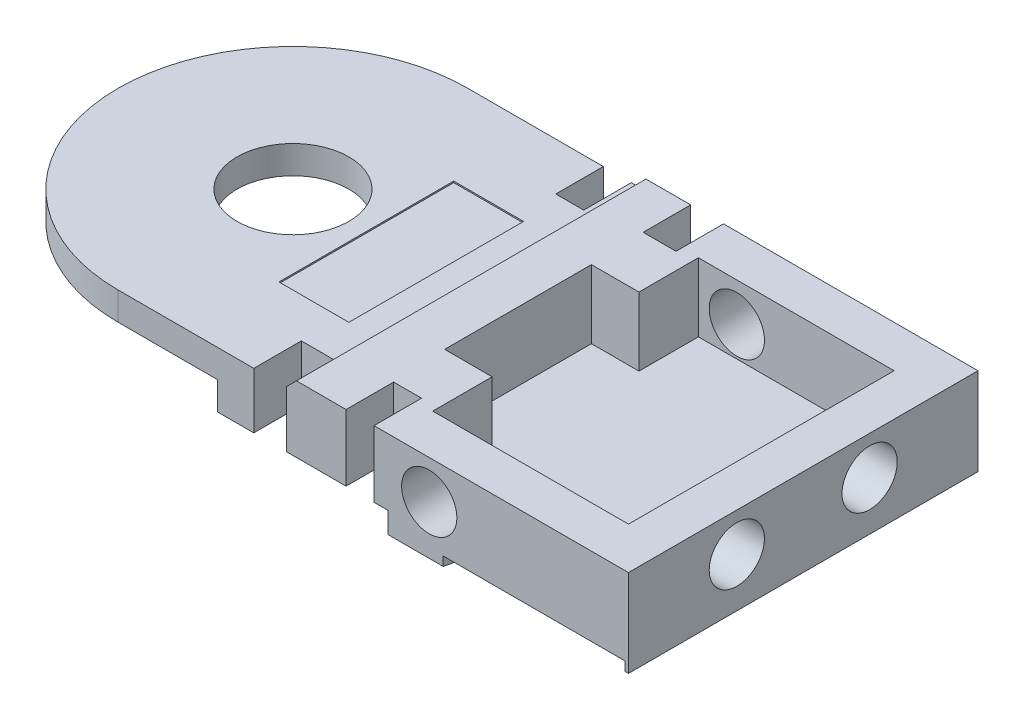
ISO-10303-21;
HEADER;
FILE_DESCRIPTION(('STEP AP214'),'2;1');
FILE_NAME('part.step','',(''),(''),'','','');
FILE_SCHEMA(('AUTOMOTIVE_DESIGN { 1 0 10303 214 1 1 1 1 }'));
ENDSEC;
DATA;
#1=APPLICATION_CONTEXT('core data for automotive mechanical design processes');
#2=APPLICATION_PROTOCOL_DEFINITION('international standard','automotive_design',2000,#1);
#3=PRODUCT_CONTEXT('',#1,'mechanical');
#4=PRODUCT('Part','Part','',(#3));
#5=PRODUCT_RELATED_PRODUCT_CATEGORY('part','',(#4));
#6=PRODUCT_DEFINITION_FORMATION('','',#4);
#7=PRODUCT_DEFINITION_CONTEXT('part definition',#1,'design');
#8=PRODUCT_DEFINITION('design','',#6,#7);
#9=PRODUCT_DEFINITION_SHAPE('','',#8);
#10=(LENGTH_UNIT() NAMED_UNIT(*) SI_UNIT(.MILLI.,.METRE.));
#11=(NAMED_UNIT(*) PLANE_ANGLE_UNIT() SI_UNIT($,.RADIAN.));
#12=(NAMED_UNIT(*) SI_UNIT($,.STERADIAN.) SOLID_ANGLE_UNIT());
#13=UNCERTAINTY_MEASURE_WITH_UNIT(LENGTH_MEASURE(1.E-05),#10,'distance_accuracy_value','');
#14=(GEOMETRIC_REPRESENTATION_CONTEXT(3) GLOBAL_UNCERTAINTY_ASSIGNED_CONTEXT((#13)) GLOBAL_UNIT_ASSIGNED_CONTEXT((#10,
#11,#12)) REPRESENTATION_CONTEXT('',''));
#15=CARTESIAN_POINT('',(0.,0.,0.));
#16=DIRECTION('',(0.,0.,1.));
#17=DIRECTION('',(1.,0.,0.));
#18=AXIS2_PLACEMENT_3D('',#15,#16,#17);
#19=CARTESIAN_POINT('',(-103.,124.7,166.));
#20=DIRECTION('',(0.,1.,0.));
#21=DIRECTION('',(0.,0.,1.));
#22=AXIS2_PLACEMENT_3D('',#19,#20,#21);
#23=PLANE('',#22);
#24=DIRECTION('',(0.,0.,-1.));
#25=VECTOR('',#24,1.);
#26=CARTESIAN_POINT('',(-123.8,124.7,166.));
#27=LINE('',#26,#25);
#28=CARTESIAN_POINT('',(-123.8,124.7,176.5));
#29=VERTEX_POINT('',#28);
#30=CARTESIAN_POINT('',(-123.8,124.7,155.5));
#31=VERTEX_POINT('',#30);
#32=EDGE_CURVE('E774',#29,#31,#27,.T.);
#33=ORIENTED_EDGE('',*,*,#32,.F.);
#34=DIRECTION('',(1.,0.,0.));
#35=VECTOR('',#34,1.);
#36=CARTESIAN_POINT('',(-120.4,124.7,176.5));
#37=LINE('',#36,#35);
#38=CARTESIAN_POINT('',(-117.,124.7,176.5));
#39=VERTEX_POINT('',#38);
#40=EDGE_CURVE('E769',#29,#39,#37,.T.);
#41=ORIENTED_EDGE('',*,*,#40,.T.);
#42=DIRECTION('',(0.,0.,-1.));
#43=VECTOR('',#42,1.);
#44=CARTESIAN_POINT('',(-117.,124.7,166.));
#45=LINE('',#44,#43);
#46=CARTESIAN_POINT('',(-117.,124.7,185.));
#47=VERTEX_POINT('',#46);
#48=EDGE_CURVE('E521',#47,#39,#45,.T.);
#49=ORIENTED_EDGE('',*,*,#48,.F.);
#50=DIRECTION('',(1.,0.,0.));
#51=VECTOR('',#50,1.);
#52=CARTESIAN_POINT('',(-103.,124.7,185.));
#53=LINE('',#52,#51);
#54=CARTESIAN_POINT('',(-89.,124.7,185.));
#55=VERTEX_POINT('',#54);
#56=EDGE_CURVE('E512',#47,#55,#53,.T.);
#57=ORIENTED_EDGE('',*,*,#56,.T.);
#58=DIRECTION('',(0.,0.,1.));
#59=VECTOR('',#58,1.);
#60=CARTESIAN_POINT('',(-89.,124.7,166.));
#61=LINE('',#60,#59);
#62=CARTESIAN_POINT('',(-89.,124.7,147.));
#63=VERTEX_POINT('',#62);
#64=EDGE_CURVE('E505',#63,#55,#61,.T.);
#65=ORIENTED_EDGE('',*,*,#64,.F.);
#66=DIRECTION('',(1.,0.,0.));
#67=VECTOR('',#66,1.);
#68=CARTESIAN_POINT('',(-103.,124.7,147.));
#69=LINE('',#68,#67);
#70=CARTESIAN_POINT('',(-117.,124.7,147.));
#71=VERTEX_POINT('',#70);
#72=EDGE_CURVE('E501',#71,#63,#69,.T.);
#73=ORIENTED_EDGE('',*,*,#72,.F.);
#74=DIRECTION('',(0.,0.,-1.));
#75=VECTOR('',#74,1.);
#76=CARTESIAN_POINT('',(-117.,124.7,166.));
#77=LINE('',#76,#75);
#78=CARTESIAN_POINT('',(-117.,124.7,155.5));
#79=VERTEX_POINT('',#78);
#80=EDGE_CURVE('E782',#79,#71,#77,.T.);
#81=ORIENTED_EDGE('',*,*,#80,.F.);
#82=DIRECTION('',(1.,0.,0.));
#83=VECTOR('',#82,1.);
#84=CARTESIAN_POINT('',(-120.4,124.7,155.5));
#85=LINE('',#84,#83);
#86=EDGE_CURVE('E778',#31,#79,#85,.T.);
#87=ORIENTED_EDGE('',*,*,#86,.F.);
#88=EDGE_LOOP('',(#33,#41,#49,#57,#65,#73,#81,#87));
#89=FACE_BOUND('',#88,.T.);
#90=ADVANCED_FACE('F16',(#89),#23,.T.);
#91=CARTESIAN_POINT('',(-111.5,129.,166.));
#92=DIRECTION('',(0.,0.,1.));
#93=DIRECTION('',(1.,0.,0.));
#94=AXIS2_PLACEMENT_3D('',#91,#92,#93);
#95=CYLINDRICAL_SURFACE('',#94,3.95);
#96=CARTESIAN_POINT('',(-111.5,129.,141.));
#97=DIRECTION('',(0.,0.,1.));
#98=DIRECTION('',(1.,0.,0.));
#99=AXIS2_PLACEMENT_3D('',#96,#97,#98);
#100=CIRCLE('',#99,3.95);
#101=CARTESIAN_POINT('',(-107.55,129.,141.));
#102=VERTEX_POINT('',#101);
#103=EDGE_CURVE('E494',#102,#102,#100,.F.);
#104=ORIENTED_EDGE('',*,*,#103,.T.);
#105=EDGE_LOOP('',(#104));
#106=FACE_BOUND('',#105,.T.);
#107=CARTESIAN_POINT('',(-111.5,129.,147.));
#108=DIRECTION('',(0.,0.,1.));
#109=DIRECTION('',(1.,0.,0.));
#110=AXIS2_PLACEMENT_3D('',#107,#108,#109);
#111=CIRCLE('',#110,3.95);
#112=CARTESIAN_POINT('',(-107.55,129.,147.));
#113=VERTEX_POINT('',#112);
#114=EDGE_CURVE('E498',#113,#113,#111,.F.);
#115=ORIENTED_EDGE('',*,*,#114,.F.);
#116=EDGE_LOOP('',(#115));
#117=FACE_BOUND('',#116,.T.);
#118=ADVANCED_FACE('F1786',(#106,#117),#95,.F.);
#119=CARTESIAN_POINT('',(-96.5,123.3,145.850435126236));
#120=DIRECTION('',(0.,1.,0.));
#121=DIRECTION('',(0.,0.,1.));
#122=AXIS2_PLACEMENT_3D('',#119,#120,#121);
#123=PLANE('',#122);
#124=DIRECTION('',(1.,0.,0.));
#125=VECTOR('',#124,1.);
#126=CARTESIAN_POINT('',(-88.8,123.3,153.));
#127=LINE('',#126,#125);
#128=CARTESIAN_POINT('',(-86.1,123.3,153.));
#129=VERTEX_POINT('',#128);
#130=CARTESIAN_POINT('',(-91.5,123.3,153.));
#131=VERTEX_POINT('',#130);
#132=EDGE_CURVE('E679',#129,#131,#127,.F.);
#133=ORIENTED_EDGE('',*,*,#132,.T.);
#134=DIRECTION('',(0.,0.,1.));
#135=VECTOR('',#134,1.);
#136=CARTESIAN_POINT('',(-91.5,123.3,152.));
#137=LINE('',#136,#135);
#138=CARTESIAN_POINT('',(-91.5,123.3,151.));
#139=VERTEX_POINT('',#138);
#140=EDGE_CURVE('E685',#131,#139,#137,.F.);
#141=ORIENTED_EDGE('',*,*,#140,.T.);
#142=DIRECTION('',(-1.,0.,0.));
#143=VECTOR('',#142,1.);
#144=CARTESIAN_POINT('',(-89.8,123.3,151.));
#145=LINE('',#144,#143);
#146=CARTESIAN_POINT('',(-88.1,123.3,151.));
#147=VERTEX_POINT('',#146);
#148=EDGE_CURVE('E691',#139,#147,#145,.F.);
#149=ORIENTED_EDGE('',*,*,#148,.T.);
#150=DIRECTION('',(-0.211753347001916,0.,0.97732314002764));
#151=VECTOR('',#150,1.);
#152=CARTESIAN_POINT('',(-87.23333333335,123.3,147.));
#153=LINE('',#152,#151);
#154=CARTESIAN_POINT('',(-86.3666666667,123.3,143.));
#155=VERTEX_POINT('',#154);
#156=EDGE_CURVE('E697',#147,#155,#153,.F.);
#157=ORIENTED_EDGE('',*,*,#156,.T.);
#158=DIRECTION('',(1.,0.,0.));
#159=VECTOR('',#158,1.);
#160=CARTESIAN_POINT('',(-103.2333333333,123.3,143.));
#161=LINE('',#160,#159);
#162=CARTESIAN_POINT('',(-106.6333333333,123.3,143.));
#163=VERTEX_POINT('',#162);
#164=EDGE_CURVE('E703',#155,#163,#161,.F.);
#165=ORIENTED_EDGE('',*,*,#164,.T.);
#166=DIRECTION('',(-0.211753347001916,0.,-0.97732314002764));
#167=VECTOR('',#166,1.);
#168=CARTESIAN_POINT('',(-105.76666666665,123.3,147.));
#169=LINE('',#168,#167);
#170=CARTESIAN_POINT('',(-104.9,123.3,151.));
#171=VERTEX_POINT('',#170);
#172=EDGE_CURVE('E709',#163,#171,#169,.F.);
#173=ORIENTED_EDGE('',*,*,#172,.T.);
#174=DIRECTION('',(-1.,0.,0.));
#175=VECTOR('',#174,1.);
#176=CARTESIAN_POINT('',(-103.2,123.3,151.));
#177=LINE('',#176,#175);
#178=CARTESIAN_POINT('',(-101.5,123.3,151.));
#179=VERTEX_POINT('',#178);
#180=EDGE_CURVE('E715',#171,#179,#177,.F.);
#181=ORIENTED_EDGE('',*,*,#180,.T.);
#182=DIRECTION('',(0.,0.,-1.));
#183=VECTOR('',#182,1.);
#184=CARTESIAN_POINT('',(-101.5,123.3,152.));
#185=LINE('',#184,#183);
#186=CARTESIAN_POINT('',(-101.5,123.3,153.));
#187=VERTEX_POINT('',#186);
#188=EDGE_CURVE('E721',#179,#187,#185,.F.);
#189=ORIENTED_EDGE('',*,*,#188,.T.);
#190=DIRECTION('',(1.,0.,0.));
#191=VECTOR('',#190,1.);
#192=CARTESIAN_POINT('',(-104.2,123.3,153.));
#193=LINE('',#192,#191);
#194=CARTESIAN_POINT('',(-106.9,123.3,153.));
#195=VERTEX_POINT('',#194);
#196=EDGE_CURVE('E727',#187,#195,#193,.F.);
#197=ORIENTED_EDGE('',*,*,#196,.T.);
#198=DIRECTION('',(0.211753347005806,0.,0.977323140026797));
#199=VECTOR('',#198,1.);
#200=CARTESIAN_POINT('',(-108.2,123.3,147.));
#201=LINE('',#200,#199);
#202=CARTESIAN_POINT('',(-109.5,123.3,141.));
#203=VERTEX_POINT('',#202);
#204=EDGE_CURVE('E436',#195,#203,#201,.F.);
#205=ORIENTED_EDGE('',*,*,#204,.T.);
#206=DIRECTION('',(1.,0.,0.));
#207=VECTOR('',#206,1.);
#208=CARTESIAN_POINT('',(-143.25,123.3,141.));
#209=LINE('',#208,#207);
#210=CARTESIAN_POINT('',(-83.5,123.3,141.));
#211=VERTEX_POINT('',#210);
#212=EDGE_CURVE('E437',#203,#211,#209,.T.);
#213=ORIENTED_EDGE('',*,*,#212,.T.);
#214=DIRECTION('',(0.211753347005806,0.,-0.977323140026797));
#215=VECTOR('',#214,1.);
#216=CARTESIAN_POINT('',(-84.8,123.3,147.));
#217=LINE('',#216,#215);
#218=EDGE_CURVE('E446',#211,#129,#217,.F.);
#219=ORIENTED_EDGE('',*,*,#218,.T.);
#220=EDGE_LOOP('',(#133,#141,#149,#157,#165,#173,#181,#189,#197,#205,#213,#219));
#221=FACE_BOUND('',#220,.T.);
#222=ADVANCED_FACE('F1777',(#221),#123,.F.);
#223=CARTESIAN_POINT('',(-86.,129.,156.5));
#224=DIRECTION('',(-1.,0.,0.));
#225=DIRECTION('',(0.,0.,1.));
#226=AXIS2_PLACEMENT_3D('',#223,#224,#225);
#227=CYLINDRICAL_SURFACE('',#226,3.95);
#228=CARTESIAN_POINT('',(-83.,129.,156.5));
#229=DIRECTION('',(-1.,0.,0.));
#230=DIRECTION('',(0.,0.,1.));
#231=AXIS2_PLACEMENT_3D('',#228,#229,#230);
#232=CIRCLE('',#231,3.95);
#233=CARTESIAN_POINT('',(-83.,129.,160.45));
#234=VERTEX_POINT('',#233);
#235=EDGE_CURVE('E490',#234,#234,#232,.F.);
#236=ORIENTED_EDGE('',*,*,#235,.T.);
#237=EDGE_LOOP('',(#236));
#238=FACE_BOUND('',#237,.T.);
#239=CARTESIAN_POINT('',(-89.,129.,156.5));
#240=DIRECTION('',(-1.,0.,0.));
#241=DIRECTION('',(0.,0.,1.));
#242=AXIS2_PLACEMENT_3D('',#239,#240,#241);
#243=CIRCLE('',#242,3.95);
#244=CARTESIAN_POINT('',(-89.,129.,160.45));
#245=VERTEX_POINT('',#244);
#246=EDGE_CURVE('E506',#245,#245,#243,.F.);
#247=ORIENTED_EDGE('',*,*,#246,.F.);
#248=EDGE_LOOP('',(#247));
#249=FACE_BOUND('',#248,.T.);
#250=ADVANCED_FACE('F1768',(#238,#249),#227,.F.);
#251=CARTESIAN_POINT('',(-86.,129.,175.5));
#252=DIRECTION('',(-1.,0.,0.));
#253=DIRECTION('',(0.,0.,1.));
#254=AXIS2_PLACEMENT_3D('',#251,#252,#253);
#255=CYLINDRICAL_SURFACE('',#254,3.95);
#256=CARTESIAN_POINT('',(-83.,129.,175.5));
#257=DIRECTION('',(-1.,0.,0.));
#258=DIRECTION('',(0.,0.,1.));
#259=AXIS2_PLACEMENT_3D('',#256,#257,#258);
#260=CIRCLE('',#259,3.95);
#261=CARTESIAN_POINT('',(-83.,129.,179.45));
#262=VERTEX_POINT('',#261);
#263=EDGE_CURVE('E487',#262,#262,#260,.F.);
#264=ORIENTED_EDGE('',*,*,#263,.T.);
#265=EDGE_LOOP('',(#264));
#266=FACE_BOUND('',#265,.T.);
#267=CARTESIAN_POINT('',(-89.,129.,175.5));
#268=DIRECTION('',(-1.,0.,0.));
#269=DIRECTION('',(0.,0.,1.));
#270=AXIS2_PLACEMENT_3D('',#267,#268,#269);
#271=CIRCLE('',#270,3.95);
#272=CARTESIAN_POINT('',(-89.,129.,179.45));
#273=VERTEX_POINT('',#272);
#274=EDGE_CURVE('E503',#273,#273,#271,.F.);
#275=ORIENTED_EDGE('',*,*,#274,.F.);
#276=EDGE_LOOP('',(#275));
#277=FACE_BOUND('',#276,.T.);
#278=ADVANCED_FACE('F1759',(#266,#277),#255,.F.);
#279=CARTESIAN_POINT('',(-111.5,129.,166.));
#280=DIRECTION('',(0.,0.,1.));
#281=DIRECTION('',(1.,0.,0.));
#282=AXIS2_PLACEMENT_3D('',#279,#280,#281);
#283=CYLINDRICAL_SURFACE('',#282,3.95);
#284=CARTESIAN_POINT('',(-111.5,129.,185.));
#285=DIRECTION('',(0.,0.,1.));
#286=DIRECTION('',(1.,0.,0.));
#287=AXIS2_PLACEMENT_3D('',#284,#285,#286);
#288=CIRCLE('',#287,3.95);
#289=CARTESIAN_POINT('',(-107.55,129.,185.));
#290=VERTEX_POINT('',#289);
#291=EDGE_CURVE('E19',#290,#290,#288,.F.);
#292=ORIENTED_EDGE('',*,*,#291,.T.);
#293=EDGE_LOOP('',(#292));
#294=FACE_BOUND('',#293,.T.);
#295=CARTESIAN_POINT('',(-111.5,129.,191.));
#296=DIRECTION('',(0.,0.,1.));
#297=DIRECTION('',(1.,0.,0.));
#298=AXIS2_PLACEMENT_3D('',#295,#296,#297);
#299=CIRCLE('',#298,3.95);
#300=CARTESIAN_POINT('',(-107.55,129.,191.));
#301=VERTEX_POINT('',#300);
#302=EDGE_CURVE('E482',#301,#301,#299,.F.);
#303=ORIENTED_EDGE('',*,*,#302,.F.);
#304=EDGE_LOOP('',(#303));
#305=FACE_BOUND('',#304,.T.);
#306=ADVANCED_FACE('F1097',(#294,#305),#283,.F.);
#307=CARTESIAN_POINT('',(-96.5,123.3,186.149564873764));
#308=DIRECTION('',(0.,-1.,0.));
#309=DIRECTION('',(0.,0.,-1.));
#310=AXIS2_PLACEMENT_3D('',#307,#308,#309);
#311=PLANE('',#310);
#312=DIRECTION('',(-1.,0.,0.));
#313=VECTOR('',#312,1.);
#314=CARTESIAN_POINT('',(-88.8,123.3,179.));
#315=LINE('',#314,#313);
#316=CARTESIAN_POINT('',(-91.5,123.3,179.));
#317=VERTEX_POINT('',#316);
#318=CARTESIAN_POINT('',(-86.1,123.3,179.));
#319=VERTEX_POINT('',#318);
#320=EDGE_CURVE('E573',#317,#319,#315,.F.);
#321=ORIENTED_EDGE('',*,*,#320,.T.);
#322=DIRECTION('',(-0.211753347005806,0.,-0.977323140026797));
#323=VECTOR('',#322,1.);
#324=CARTESIAN_POINT('',(-84.8,123.3,185.));
#325=LINE('',#324,#323);
#326=CARTESIAN_POINT('',(-83.5,123.3,191.));
#327=VERTEX_POINT('',#326);
#328=EDGE_CURVE('E570',#319,#327,#325,.F.);
#329=ORIENTED_EDGE('',*,*,#328,.T.);
#330=DIRECTION('',(1.,0.,0.));
#331=VECTOR('',#330,1.);
#332=CARTESIAN_POINT('',(-143.25,123.3,191.));
#333=LINE('',#332,#331);
#334=CARTESIAN_POINT('',(-109.5,123.3,191.));
#335=VERTEX_POINT('',#334);
#336=EDGE_CURVE('E576',#335,#327,#333,.T.);
#337=ORIENTED_EDGE('',*,*,#336,.F.);
#338=DIRECTION('',(-0.211753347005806,0.,0.977323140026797));
#339=VECTOR('',#338,1.);
#340=CARTESIAN_POINT('',(-108.2,123.3,185.));
#341=LINE('',#340,#339);
#342=CARTESIAN_POINT('',(-106.9,123.3,179.));
#343=VERTEX_POINT('',#342);
#344=EDGE_CURVE('E581',#335,#343,#341,.F.);
#345=ORIENTED_EDGE('',*,*,#344,.T.);
#346=DIRECTION('',(-1.,0.,0.));
#347=VECTOR('',#346,1.);
#348=CARTESIAN_POINT('',(-104.2,123.3,179.));
#349=LINE('',#348,#347);
#350=CARTESIAN_POINT('',(-101.5,123.3,179.));
#351=VERTEX_POINT('',#350);
#352=EDGE_CURVE('E587',#343,#351,#349,.F.);
#353=ORIENTED_EDGE('',*,*,#352,.T.);
#354=DIRECTION('',(0.,0.,-1.));
#355=VECTOR('',#354,1.);
#356=CARTESIAN_POINT('',(-101.5,123.3,180.));
#357=LINE('',#356,#355);
#358=CARTESIAN_POINT('',(-101.5,123.3,181.));
#359=VERTEX_POINT('',#358);
#360=EDGE_CURVE('E593',#351,#359,#357,.F.);
#361=ORIENTED_EDGE('',*,*,#360,.T.);
#362=DIRECTION('',(1.,0.,0.));
#363=VECTOR('',#362,1.);
#364=CARTESIAN_POINT('',(-103.2,123.3,181.));
#365=LINE('',#364,#363);
#366=CARTESIAN_POINT('',(-104.9,123.3,181.));
#367=VERTEX_POINT('',#366);
#368=EDGE_CURVE('E599',#359,#367,#365,.F.);
#369=ORIENTED_EDGE('',*,*,#368,.T.);
#370=DIRECTION('',(0.211753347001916,0.,-0.97732314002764));
#371=VECTOR('',#370,1.);
#372=CARTESIAN_POINT('',(-105.76666666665,123.3,185.));
#373=LINE('',#372,#371);
#374=CARTESIAN_POINT('',(-106.6333333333,123.3,189.));
#375=VERTEX_POINT('',#374);
#376=EDGE_CURVE('E605',#367,#375,#373,.F.);
#377=ORIENTED_EDGE('',*,*,#376,.T.);
#378=DIRECTION('',(-1.,0.,0.));
#379=VECTOR('',#378,1.);
#380=CARTESIAN_POINT('',(-93.1,123.3,189.));
#381=LINE('',#380,#379);
#382=CARTESIAN_POINT('',(-86.3666666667,123.3,189.));
#383=VERTEX_POINT('',#382);
#384=EDGE_CURVE('E611',#375,#383,#381,.F.);
#385=ORIENTED_EDGE('',*,*,#384,.T.);
#386=DIRECTION('',(0.211753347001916,0.,0.97732314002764));
#387=VECTOR('',#386,1.);
#388=CARTESIAN_POINT('',(-87.23333333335,123.3,185.));
#389=LINE('',#388,#387);
#390=CARTESIAN_POINT('',(-88.1,123.3,181.));
#391=VERTEX_POINT('',#390);
#392=EDGE_CURVE('E617',#383,#391,#389,.F.);
#393=ORIENTED_EDGE('',*,*,#392,.T.);
#394=DIRECTION('',(1.,0.,0.));
#395=VECTOR('',#394,1.);
#396=CARTESIAN_POINT('',(-89.8,123.3,181.));
#397=LINE('',#396,#395);
#398=CARTESIAN_POINT('',(-91.5,123.3,181.));
#399=VERTEX_POINT('',#398);
#400=EDGE_CURVE('E623',#391,#399,#397,.F.);
#401=ORIENTED_EDGE('',*,*,#400,.T.);
#402=DIRECTION('',(0.,0.,1.));
#403=VECTOR('',#402,1.);
#404=CARTESIAN_POINT('',(-91.5,123.3,180.));
#405=LINE('',#404,#403);
#406=EDGE_CURVE('E629',#399,#317,#405,.F.);
#407=ORIENTED_EDGE('',*,*,#406,.T.);
#408=EDGE_LOOP('',(#321,#329,#337,#345,#353,#361,#369,#377,#385,#393,#401,#407));
#409=FACE_BOUND('',#408,.T.);
#410=ADVANCED_FACE('F1089',(#409),#311,.T.);
#411=CARTESIAN_POINT('',(-117.,129.6,166.));
#412=DIRECTION('',(1.,0.,0.));
#413=DIRECTION('',(0.,0.,-1.));
#414=AXIS2_PLACEMENT_3D('',#411,#412,#413);
#415=PLANE('',#414);
#416=DIRECTION('',(0.,1.,0.));
#417=VECTOR('',#416,1.);
#418=CARTESIAN_POINT('',(-117.,129.6,185.));
#419=LINE('',#418,#417);
#420=CARTESIAN_POINT('',(-117.,134.5,185.));
#421=VERTEX_POINT('',#420);
#422=EDGE_CURVE('E508',#421,#47,#419,.F.);
#423=ORIENTED_EDGE('',*,*,#422,.T.);
#424=ORIENTED_EDGE('',*,*,#48,.T.);
#425=DIRECTION('',(0.,1.,0.));
#426=VECTOR('',#425,1.);
#427=CARTESIAN_POINT('',(-117.,129.6,176.5));
#428=LINE('',#427,#426);
#429=CARTESIAN_POINT('',(-117.,134.5,176.5));
#430=VERTEX_POINT('',#429);
#431=EDGE_CURVE('E766',#39,#430,#428,.T.);
#432=ORIENTED_EDGE('',*,*,#431,.T.);
#433=DIRECTION('',(0.,0.,-1.));
#434=VECTOR('',#433,1.);
#435=CARTESIAN_POINT('',(-117.,134.5,166.));
#436=LINE('',#435,#434);
#437=EDGE_CURVE('E757',#430,#421,#436,.F.);
#438=ORIENTED_EDGE('',*,*,#437,.T.);
#439=EDGE_LOOP('',(#423,#424,#432,#438));
#440=FACE_BOUND('',#439,.T.);
#441=ADVANCED_FACE('F1087',(#440),#415,.T.);
#442=CARTESIAN_POINT('',(-103.,129.6,185.));
#443=DIRECTION('',(0.,0.,1.));
#444=DIRECTION('',(1.,0.,0.));
#445=AXIS2_PLACEMENT_3D('',#442,#443,#444);
#446=PLANE('',#445);
#447=DIRECTION('',(1.,0.,0.));
#448=VECTOR('',#447,1.);
#449=CARTESIAN_POINT('',(-106.75,134.5,185.));
#450=LINE('',#449,#448);
#451=CARTESIAN_POINT('',(-89.,134.5,185.));
#452=VERTEX_POINT('',#451);
#453=EDGE_CURVE('E803',#421,#452,#450,.T.);
#454=ORIENTED_EDGE('',*,*,#453,.T.);
#455=DIRECTION('',(0.,1.,0.));
#456=VECTOR('',#455,1.);
#457=CARTESIAN_POINT('',(-89.,129.6,185.));
#458=LINE('',#457,#456);
#459=EDGE_CURVE('E502',#55,#452,#458,.T.);
#460=ORIENTED_EDGE('',*,*,#459,.F.);
#461=ORIENTED_EDGE('',*,*,#56,.F.);
#462=ORIENTED_EDGE('',*,*,#422,.F.);
#463=EDGE_LOOP('',(#454,#460,#461,#462));
#464=FACE_BOUND('',#463,.T.);
#465=ORIENTED_EDGE('',*,*,#291,.F.);
#466=EDGE_LOOP('',(#465));
#467=FACE_BOUND('',#466,.T.);
#468=ADVANCED_FACE('F800',(#464,#467),#446,.F.);
#469=CARTESIAN_POINT('',(-89.,129.6,166.));
#470=DIRECTION('',(-1.,0.,0.));
#471=DIRECTION('',(0.,0.,1.));
#472=AXIS2_PLACEMENT_3D('',#469,#470,#471);
#473=PLANE('',#472);
#474=DIRECTION('',(0.,0.,-1.));
#475=VECTOR('',#474,1.);
#476=CARTESIAN_POINT('',(-89.,134.5,166.));
#477=LINE('',#476,#475);
#478=CARTESIAN_POINT('',(-89.,134.5,147.));
#479=VERTEX_POINT('',#478);
#480=EDGE_CURVE('E805',#452,#479,#477,.T.);
#481=ORIENTED_EDGE('',*,*,#480,.T.);
#482=DIRECTION('',(0.,1.,0.));
#483=VECTOR('',#482,1.);
#484=CARTESIAN_POINT('',(-89.,129.6,147.));
#485=LINE('',#484,#483);
#486=EDGE_CURVE('E784',#63,#479,#485,.T.);
#487=ORIENTED_EDGE('',*,*,#486,.F.);
#488=ORIENTED_EDGE('',*,*,#64,.T.);
#489=ORIENTED_EDGE('',*,*,#459,.T.);
#490=EDGE_LOOP('',(#481,#487,#488,#489));
#491=FACE_BOUND('',#490,.T.);
#492=ORIENTED_EDGE('',*,*,#274,.T.);
#493=EDGE_LOOP('',(#492));
#494=FACE_BOUND('',#493,.T.);
#495=ORIENTED_EDGE('',*,*,#246,.T.);
#496=EDGE_LOOP('',(#495));
#497=FACE_BOUND('',#496,.T.);
#498=ADVANCED_FACE('F792',(#491,#494,#497),#473,.T.);
#499=CARTESIAN_POINT('',(-103.,129.6,147.));
#500=DIRECTION('',(0.,0.,1.));
#501=DIRECTION('',(1.,0.,0.));
#502=AXIS2_PLACEMENT_3D('',#499,#500,#501);
#503=PLANE('',#502);
#504=ORIENTED_EDGE('',*,*,#486,.T.);
#505=DIRECTION('',(1.,0.,0.));
#506=VECTOR('',#505,1.);
#507=CARTESIAN_POINT('',(-106.75,134.5,147.));
#508=LINE('',#507,#506);
#509=CARTESIAN_POINT('',(-117.,134.5,147.));
#510=VERTEX_POINT('',#509);
#511=EDGE_CURVE('E807',#479,#510,#508,.F.);
#512=ORIENTED_EDGE('',*,*,#511,.T.);
#513=DIRECTION('',(0.,1.,0.));
#514=VECTOR('',#513,1.);
#515=CARTESIAN_POINT('',(-117.,129.6,147.));
#516=LINE('',#515,#514);
#517=EDGE_CURVE('E780',#71,#510,#516,.T.);
#518=ORIENTED_EDGE('',*,*,#517,.F.);
#519=ORIENTED_EDGE('',*,*,#72,.T.);
#520=EDGE_LOOP('',(#504,#512,#518,#519));
#521=FACE_BOUND('',#520,.T.);
#522=ORIENTED_EDGE('',*,*,#114,.T.);
#523=EDGE_LOOP('',(#522));
#524=FACE_BOUND('',#523,.T.);
#525=ADVANCED_FACE('F1067',(#521,#524),#503,.T.);
#526=CARTESIAN_POINT('',(-117.,129.6,166.));
#527=DIRECTION('',(1.,0.,0.));
#528=DIRECTION('',(0.,0.,-1.));
#529=AXIS2_PLACEMENT_3D('',#526,#527,#528);
#530=PLANE('',#529);
#531=ORIENTED_EDGE('',*,*,#517,.T.);
#532=DIRECTION('',(0.,0.,-1.));
#533=VECTOR('',#532,1.);
#534=CARTESIAN_POINT('',(-117.,134.5,166.));
#535=LINE('',#534,#533);
#536=CARTESIAN_POINT('',(-117.,134.5,155.5));
#537=VERTEX_POINT('',#536);
#538=EDGE_CURVE('E1061',#510,#537,#535,.F.);
#539=ORIENTED_EDGE('',*,*,#538,.T.);
#540=DIRECTION('',(0.,1.,0.));
#541=VECTOR('',#540,1.);
#542=CARTESIAN_POINT('',(-117.,129.6,155.5));
#543=LINE('',#542,#541);
#544=EDGE_CURVE('E776',#79,#537,#543,.T.);
#545=ORIENTED_EDGE('',*,*,#544,.F.);
#546=ORIENTED_EDGE('',*,*,#80,.T.);
#547=EDGE_LOOP('',(#531,#539,#545,#546));
#548=FACE_BOUND('',#547,.T.);
#549=ADVANCED_FACE('F1075',(#548),#530,.T.);
#550=CARTESIAN_POINT('',(-120.4,129.6,155.5));
#551=DIRECTION('',(0.,0.,1.));
#552=DIRECTION('',(1.,0.,0.));
#553=AXIS2_PLACEMENT_3D('',#550,#551,#552);
#554=PLANE('',#553);
#555=ORIENTED_EDGE('',*,*,#544,.T.);
#556=DIRECTION('',(1.,0.,0.));
#557=VECTOR('',#556,1.);
#558=CARTESIAN_POINT('',(-106.75,134.5,155.5));
#559=LINE('',#558,#557);
#560=CARTESIAN_POINT('',(-123.8,134.5,155.5));
#561=VERTEX_POINT('',#560);
#562=EDGE_CURVE('E1058',#537,#561,#559,.F.);
#563=ORIENTED_EDGE('',*,*,#562,.T.);
#564=DIRECTION('',(0.,1.,0.));
#565=VECTOR('',#564,1.);
#566=CARTESIAN_POINT('',(-123.8,129.6,155.5));
#567=LINE('',#566,#565);
#568=EDGE_CURVE('E772',#31,#561,#567,.T.);
#569=ORIENTED_EDGE('',*,*,#568,.F.);
#570=ORIENTED_EDGE('',*,*,#86,.T.);
#571=EDGE_LOOP('',(#555,#563,#569,#570));
#572=FACE_BOUND('',#571,.T.);
#573=ADVANCED_FACE('F1080',(#572),#554,.T.);
#574=CARTESIAN_POINT('',(-123.8,129.6,166.));
#575=DIRECTION('',(1.,0.,0.));
#576=DIRECTION('',(0.,0.,-1.));
#577=AXIS2_PLACEMENT_3D('',#574,#575,#576);
#578=PLANE('',#577);
#579=ORIENTED_EDGE('',*,*,#568,.T.);
#580=DIRECTION('',(0.,0.,-1.));
#581=VECTOR('',#580,1.);
#582=CARTESIAN_POINT('',(-123.8,134.5,166.));
#583=LINE('',#582,#581);
#584=CARTESIAN_POINT('',(-123.8,134.5,176.5));
#585=VERTEX_POINT('',#584);
#586=EDGE_CURVE('E1055',#561,#585,#583,.F.);
#587=ORIENTED_EDGE('',*,*,#586,.T.);
#588=DIRECTION('',(0.,1.,0.));
#589=VECTOR('',#588,1.);
#590=CARTESIAN_POINT('',(-123.8,129.6,176.5));
#591=LINE('',#590,#589);
#592=EDGE_CURVE('E497',#585,#29,#591,.F.);
#593=ORIENTED_EDGE('',*,*,#592,.T.);
#594=ORIENTED_EDGE('',*,*,#32,.T.);
#595=EDGE_LOOP('',(#579,#587,#593,#594));
#596=FACE_BOUND('',#595,.T.);
#597=ADVANCED_FACE('F1082',(#596),#578,.T.);
#598=CARTESIAN_POINT('',(-120.4,129.6,176.5));
#599=DIRECTION('',(0.,0.,1.));
#600=DIRECTION('',(1.,0.,0.));
#601=AXIS2_PLACEMENT_3D('',#598,#599,#600);
#602=PLANE('',#601);
#603=DIRECTION('',(1.,0.,0.));
#604=VECTOR('',#603,1.);
#605=CARTESIAN_POINT('',(-106.75,134.5,176.5));
#606=LINE('',#605,#604);
#607=EDGE_CURVE('E752',#585,#430,#606,.T.);
#608=ORIENTED_EDGE('',*,*,#607,.T.);
#609=ORIENTED_EDGE('',*,*,#431,.F.);
#610=ORIENTED_EDGE('',*,*,#40,.F.);
#611=ORIENTED_EDGE('',*,*,#592,.F.);
#612=EDGE_LOOP('',(#608,#609,#610,#611));
#613=FACE_BOUND('',#612,.T.);
#614=ADVANCED_FACE('F1086',(#613),#602,.F.);
#615=CARTESIAN_POINT('',(-143.25,62.5,141.));
#616=DIRECTION('',(0.,0.,1.));
#617=DIRECTION('',(1.,0.,0.));
#618=AXIS2_PLACEMENT_3D('',#615,#616,#617);
#619=PLANE('',#618);
#620=DIRECTION('',(1.,0.,0.));
#621=VECTOR('',#620,1.);
#622=CARTESIAN_POINT('',(-136.7,125.,141.));
#623=LINE('',#622,#621);
#624=CARTESIAN_POINT('',(-119.4,125.,141.));
#625=VERTEX_POINT('',#624);
#626=CARTESIAN_POINT('',(-117.4,125.,141.));
#627=VERTEX_POINT('',#626);
#628=EDGE_CURVE('E529',#625,#627,#623,.T.);
#629=ORIENTED_EDGE('',*,*,#628,.F.);
#630=DIRECTION('',(0.,1.,0.));
#631=VECTOR('',#630,1.);
#632=CARTESIAN_POINT('',(-119.4,128.5,141.));
#633=LINE('',#632,#631);
#634=CARTESIAN_POINT('',(-119.4,134.5,141.));
#635=VERTEX_POINT('',#634);
#636=EDGE_CURVE('E525',#635,#625,#633,.F.);
#637=ORIENTED_EDGE('',*,*,#636,.F.);
#638=DIRECTION('',(1.,0.,0.));
#639=VECTOR('',#638,1.);
#640=CARTESIAN_POINT('',(-106.75,134.5,141.));
#641=LINE('',#640,#639);
#642=CARTESIAN_POINT('',(-83.,134.5,141.));
#643=VERTEX_POINT('',#642);
#644=EDGE_CURVE('E748',#635,#643,#641,.T.);
#645=ORIENTED_EDGE('',*,*,#644,.T.);
#646=DIRECTION('',(0.,1.,0.));
#647=VECTOR('',#646,1.);
#648=CARTESIAN_POINT('',(-83.,62.5,141.));
#649=LINE('',#648,#647);
#650=CARTESIAN_POINT('',(-83.,122.,141.));
#651=VERTEX_POINT('',#650);
#652=EDGE_CURVE('E434',#643,#651,#649,.F.);
#653=ORIENTED_EDGE('',*,*,#652,.T.);
#654=DIRECTION('',(1.,0.,0.));
#655=VECTOR('',#654,1.);
#656=CARTESIAN_POINT('',(-143.25,122.,141.));
#657=LINE('',#656,#655);
#658=CARTESIAN_POINT('',(-83.5,122.,141.));
#659=VERTEX_POINT('',#658);
#660=EDGE_CURVE('E425',#659,#651,#657,.T.);
#661=ORIENTED_EDGE('',*,*,#660,.F.);
#662=DIRECTION('',(0.,1.,0.));
#663=VECTOR('',#662,1.);
#664=CARTESIAN_POINT('',(-83.5,120.3,141.));
#665=LINE('',#664,#663);
#666=EDGE_CURVE('E432',#659,#211,#665,.T.);
#667=ORIENTED_EDGE('',*,*,#666,.T.);
#668=ORIENTED_EDGE('',*,*,#212,.F.);
#669=DIRECTION('',(0.,1.,0.));
#670=VECTOR('',#669,1.);
#671=CARTESIAN_POINT('',(-109.5,120.3,141.));
#672=LINE('',#671,#670);
#673=CARTESIAN_POINT('',(-109.5,122.,141.));
#674=VERTEX_POINT('',#673);
#675=EDGE_CURVE('E730',#203,#674,#672,.F.);
#676=ORIENTED_EDGE('',*,*,#675,.T.);
#677=DIRECTION('',(1.,0.,0.));
#678=VECTOR('',#677,1.);
#679=CARTESIAN_POINT('',(-109.5,122.,141.));
#680=LINE('',#679,#678);
#681=CARTESIAN_POINT('',(-117.4,122.,141.));
#682=VERTEX_POINT('',#681);
#683=EDGE_CURVE('E556',#682,#674,#680,.T.);
#684=ORIENTED_EDGE('',*,*,#683,.F.);
#685=DIRECTION('',(0.,1.,0.));
#686=VECTOR('',#685,1.);
#687=CARTESIAN_POINT('',(-117.4,123.5,141.));
#688=LINE('',#687,#686);
#689=EDGE_CURVE('E531',#627,#682,#688,.F.);
#690=ORIENTED_EDGE('',*,*,#689,.F.);
#691=EDGE_LOOP('',(#629,#637,#645,#653,#661,#667,#668,#676,#684,#690));
#692=FACE_BOUND('',#691,.T.);
#693=ORIENTED_EDGE('',*,*,#103,.F.);
#694=EDGE_LOOP('',(#693));
#695=FACE_BOUND('',#694,.T.);
#696=ADVANCED_FACE('F430',(#692,#695),#619,.F.);
#697=CARTESIAN_POINT('',(-108.2,120.3,147.));
#698=DIRECTION('',(-0.977323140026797,0.,0.211753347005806));
#699=DIRECTION('',(0.211753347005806,0.,0.977323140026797));
#700=AXIS2_PLACEMENT_3D('',#697,#698,#699);
#701=PLANE('',#700);
#702=ORIENTED_EDGE('',*,*,#675,.F.);
#703=ORIENTED_EDGE('',*,*,#204,.F.);
#704=DIRECTION('',(0.,1.,0.));
#705=VECTOR('',#704,1.);
#706=CARTESIAN_POINT('',(-106.9,120.3,153.));
#707=LINE('',#706,#705);
#708=CARTESIAN_POINT('',(-106.9,122.,153.));
#709=VERTEX_POINT('',#708);
#710=EDGE_CURVE('E724',#195,#709,#707,.F.);
#711=ORIENTED_EDGE('',*,*,#710,.T.);
#712=DIRECTION('',(0.211753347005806,0.,0.977323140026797));
#713=VECTOR('',#712,1.);
#714=CARTESIAN_POINT('',(-109.5,122.,141.));
#715=LINE('',#714,#713);
#716=EDGE_CURVE('E561',#674,#709,#715,.T.);
#717=ORIENTED_EDGE('',*,*,#716,.F.);
#718=EDGE_LOOP('',(#702,#703,#711,#717));
#719=FACE_BOUND('',#718,.T.);
#720=ADVANCED_FACE('F1307',(#719),#701,.F.);
#721=CARTESIAN_POINT('',(-104.2,120.3,153.));
#722=DIRECTION('',(0.,0.,1.));
#723=DIRECTION('',(1.,0.,0.));
#724=AXIS2_PLACEMENT_3D('',#721,#722,#723);
#725=PLANE('',#724);
#726=ORIENTED_EDGE('',*,*,#710,.F.);
#727=ORIENTED_EDGE('',*,*,#196,.F.);
#728=DIRECTION('',(0.,1.,0.));
#729=VECTOR('',#728,1.);
#730=CARTESIAN_POINT('',(-101.5,120.3,153.));
#731=LINE('',#730,#729);
#732=CARTESIAN_POINT('',(-101.5,122.,153.));
#733=VERTEX_POINT('',#732);
#734=EDGE_CURVE('E718',#187,#733,#731,.F.);
#735=ORIENTED_EDGE('',*,*,#734,.T.);
#736=DIRECTION('',(1.,0.,0.));
#737=VECTOR('',#736,1.);
#738=CARTESIAN_POINT('',(-109.5,122.,153.));
#739=LINE('',#738,#737);
#740=EDGE_CURVE('E1835',#709,#733,#739,.T.);
#741=ORIENTED_EDGE('',*,*,#740,.F.);
#742=EDGE_LOOP('',(#726,#727,#735,#741));
#743=FACE_BOUND('',#742,.T.);
#744=ADVANCED_FACE('F1303',(#743),#725,.F.);
#745=CARTESIAN_POINT('',(-101.5,120.3,152.));
#746=DIRECTION('',(1.,0.,0.));
#747=DIRECTION('',(0.,0.,-1.));
#748=AXIS2_PLACEMENT_3D('',#745,#746,#747);
#749=PLANE('',#748);
#750=ORIENTED_EDGE('',*,*,#734,.F.);
#751=ORIENTED_EDGE('',*,*,#188,.F.);
#752=DIRECTION('',(0.,1.,0.));
#753=VECTOR('',#752,1.);
#754=CARTESIAN_POINT('',(-101.5,120.3,151.));
#755=LINE('',#754,#753);
#756=CARTESIAN_POINT('',(-101.5,122.,151.));
#757=VERTEX_POINT('',#756);
#758=EDGE_CURVE('E712',#179,#757,#755,.F.);
#759=ORIENTED_EDGE('',*,*,#758,.T.);
#760=DIRECTION('',(0.,0.,-1.));
#761=VECTOR('',#760,1.);
#762=CARTESIAN_POINT('',(-101.5,122.,166.));
#763=LINE('',#762,#761);
#764=EDGE_CURVE('E1832',#733,#757,#763,.T.);
#765=ORIENTED_EDGE('',*,*,#764,.F.);
#766=EDGE_LOOP('',(#750,#751,#759,#765));
#767=FACE_BOUND('',#766,.T.);
#768=ADVANCED_FACE('F1299',(#767),#749,.F.);
#769=CARTESIAN_POINT('',(-103.2,120.3,151.));
#770=DIRECTION('',(0.,0.,-1.));
#771=DIRECTION('',(-1.,0.,0.));
#772=AXIS2_PLACEMENT_3D('',#769,#770,#771);
#773=PLANE('',#772);
#774=ORIENTED_EDGE('',*,*,#758,.F.);
#775=ORIENTED_EDGE('',*,*,#180,.F.);
#776=DIRECTION('',(0.,1.,0.));
#777=VECTOR('',#776,1.);
#778=CARTESIAN_POINT('',(-104.9,120.3,151.));
#779=LINE('',#778,#777);
#780=CARTESIAN_POINT('',(-104.9,122.,151.));
#781=VERTEX_POINT('',#780);
#782=EDGE_CURVE('E706',#171,#781,#779,.F.);
#783=ORIENTED_EDGE('',*,*,#782,.T.);
#784=DIRECTION('',(1.,0.,0.));
#785=VECTOR('',#784,1.);
#786=CARTESIAN_POINT('',(-109.5,122.,151.));
#787=LINE('',#786,#785);
#788=EDGE_CURVE('E1829',#757,#781,#787,.F.);
#789=ORIENTED_EDGE('',*,*,#788,.F.);
#790=EDGE_LOOP('',(#774,#775,#783,#789));
#791=FACE_BOUND('',#790,.T.);
#792=ADVANCED_FACE('F1295',(#791),#773,.F.);
#793=CARTESIAN_POINT('',(-105.76666666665,120.3,147.));
#794=DIRECTION('',(0.97732314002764,0.,-0.211753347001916));
#795=DIRECTION('',(-0.211753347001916,0.,-0.97732314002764));
#796=AXIS2_PLACEMENT_3D('',#793,#794,#795);
#797=PLANE('',#796);
#798=ORIENTED_EDGE('',*,*,#782,.F.);
#799=ORIENTED_EDGE('',*,*,#172,.F.);
#800=DIRECTION('',(0.,1.,0.));
#801=VECTOR('',#800,1.);
#802=CARTESIAN_POINT('',(-106.6333333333,120.3,143.));
#803=LINE('',#802,#801);
#804=CARTESIAN_POINT('',(-106.6333333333,122.,143.));
#805=VERTEX_POINT('',#804);
#806=EDGE_CURVE('E700',#163,#805,#803,.F.);
#807=ORIENTED_EDGE('',*,*,#806,.T.);
#808=DIRECTION('',(-0.211753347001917,0.,-0.97732314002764));
#809=VECTOR('',#808,1.);
#810=CARTESIAN_POINT('',(-104.9,122.,151.));
#811=LINE('',#810,#809);
#812=EDGE_CURVE('E1826',#781,#805,#811,.T.);
#813=ORIENTED_EDGE('',*,*,#812,.F.);
#814=EDGE_LOOP('',(#798,#799,#807,#813));
#815=FACE_BOUND('',#814,.T.);
#816=ADVANCED_FACE('F1291',(#815),#797,.F.);
#817=CARTESIAN_POINT('',(-103.2333333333,120.3,143.));
#818=DIRECTION('',(0.,0.,1.));
#819=DIRECTION('',(1.,0.,0.));
#820=AXIS2_PLACEMENT_3D('',#817,#818,#819);
#821=PLANE('',#820);
#822=ORIENTED_EDGE('',*,*,#806,.F.);
#823=ORIENTED_EDGE('',*,*,#164,.F.);
#824=DIRECTION('',(0.,1.,0.));
#825=VECTOR('',#824,1.);
#826=CARTESIAN_POINT('',(-86.3666666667,120.3,143.));
#827=LINE('',#826,#825);
#828=CARTESIAN_POINT('',(-86.3666666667,122.,143.));
#829=VERTEX_POINT('',#828);
#830=EDGE_CURVE('E694',#155,#829,#827,.F.);
#831=ORIENTED_EDGE('',*,*,#830,.T.);
#832=DIRECTION('',(1.,0.,0.));
#833=VECTOR('',#832,1.);
#834=CARTESIAN_POINT('',(-109.5,122.,143.));
#835=LINE('',#834,#833);
#836=EDGE_CURVE('E1823',#805,#829,#835,.T.);
#837=ORIENTED_EDGE('',*,*,#836,.F.);
#838=EDGE_LOOP('',(#822,#823,#831,#837));
#839=FACE_BOUND('',#838,.T.);
#840=ADVANCED_FACE('F1287',(#839),#821,.F.);
#841=CARTESIAN_POINT('',(-87.23333333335,120.3,147.));
#842=DIRECTION('',(-0.97732314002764,0.,-0.211753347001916));
#843=DIRECTION('',(-0.211753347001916,0.,0.97732314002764));
#844=AXIS2_PLACEMENT_3D('',#841,#842,#843);
#845=PLANE('',#844);
#846=ORIENTED_EDGE('',*,*,#830,.F.);
#847=ORIENTED_EDGE('',*,*,#156,.F.);
#848=DIRECTION('',(0.,1.,0.));
#849=VECTOR('',#848,1.);
#850=CARTESIAN_POINT('',(-88.1,120.3,151.));
#851=LINE('',#850,#849);
#852=CARTESIAN_POINT('',(-88.1,122.,151.));
#853=VERTEX_POINT('',#852);
#854=EDGE_CURVE('E688',#147,#853,#851,.F.);
#855=ORIENTED_EDGE('',*,*,#854,.T.);
#856=DIRECTION('',(-0.211753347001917,0.,0.97732314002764));
#857=VECTOR('',#856,1.);
#858=CARTESIAN_POINT('',(-86.3666666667,122.,143.));
#859=LINE('',#858,#857);
#860=EDGE_CURVE('E1820',#829,#853,#859,.T.);
#861=ORIENTED_EDGE('',*,*,#860,.F.);
#862=EDGE_LOOP('',(#846,#847,#855,#861));
#863=FACE_BOUND('',#862,.T.);
#864=ADVANCED_FACE('F1283',(#863),#845,.F.);
#865=CARTESIAN_POINT('',(-89.8,120.3,151.));
#866=DIRECTION('',(0.,0.,-1.));
#867=DIRECTION('',(-1.,0.,0.));
#868=AXIS2_PLACEMENT_3D('',#865,#866,#867);
#869=PLANE('',#868);
#870=ORIENTED_EDGE('',*,*,#854,.F.);
#871=ORIENTED_EDGE('',*,*,#148,.F.);
#872=DIRECTION('',(0.,1.,0.));
#873=VECTOR('',#872,1.);
#874=CARTESIAN_POINT('',(-91.5,120.3,151.));
#875=LINE('',#874,#873);
#876=CARTESIAN_POINT('',(-91.5,122.,151.));
#877=VERTEX_POINT('',#876);
#878=EDGE_CURVE('E682',#139,#877,#875,.F.);
#879=ORIENTED_EDGE('',*,*,#878,.T.);
#880=DIRECTION('',(1.,0.,0.));
#881=VECTOR('',#880,1.);
#882=CARTESIAN_POINT('',(-109.5,122.,151.));
#883=LINE('',#882,#881);
#884=EDGE_CURVE('E1817',#853,#877,#883,.F.);
#885=ORIENTED_EDGE('',*,*,#884,.F.);
#886=EDGE_LOOP('',(#870,#871,#879,#885));
#887=FACE_BOUND('',#886,.T.);
#888=ADVANCED_FACE('F1279',(#887),#869,.F.);
#889=CARTESIAN_POINT('',(-91.5,120.3,152.));
#890=DIRECTION('',(-1.,0.,0.));
#891=DIRECTION('',(0.,0.,1.));
#892=AXIS2_PLACEMENT_3D('',#889,#890,#891);
#893=PLANE('',#892);
#894=ORIENTED_EDGE('',*,*,#878,.F.);
#895=ORIENTED_EDGE('',*,*,#140,.F.);
#896=DIRECTION('',(0.,1.,0.));
#897=VECTOR('',#896,1.);
#898=CARTESIAN_POINT('',(-91.5,120.3,153.));
#899=LINE('',#898,#897);
#900=CARTESIAN_POINT('',(-91.5,122.,153.));
#901=VERTEX_POINT('',#900);
#902=EDGE_CURVE('E447',#131,#901,#899,.F.);
#903=ORIENTED_EDGE('',*,*,#902,.T.);
#904=DIRECTION('',(0.,0.,-1.));
#905=VECTOR('',#904,1.);
#906=CARTESIAN_POINT('',(-91.5,122.,166.));
#907=LINE('',#906,#905);
#908=EDGE_CURVE('E457',#877,#901,#907,.F.);
#909=ORIENTED_EDGE('',*,*,#908,.F.);
#910=EDGE_LOOP('',(#894,#895,#903,#909));
#911=FACE_BOUND('',#910,.T.);
#912=ADVANCED_FACE('F1275',(#911),#893,.F.);
#913=CARTESIAN_POINT('',(-88.8,120.3,153.));
#914=DIRECTION('',(0.,0.,1.));
#915=DIRECTION('',(1.,0.,0.));
#916=AXIS2_PLACEMENT_3D('',#913,#914,#915);
#917=PLANE('',#916);
#918=ORIENTED_EDGE('',*,*,#902,.F.);
#919=ORIENTED_EDGE('',*,*,#132,.F.);
#920=DIRECTION('',(0.,1.,0.));
#921=VECTOR('',#920,1.);
#922=CARTESIAN_POINT('',(-86.1,120.3,153.));
#923=LINE('',#922,#921);
#924=CARTESIAN_POINT('',(-86.1,122.,153.));
#925=VERTEX_POINT('',#924);
#926=EDGE_CURVE('E493',#129,#925,#923,.F.);
#927=ORIENTED_EDGE('',*,*,#926,.T.);
#928=DIRECTION('',(1.,0.,0.));
#929=VECTOR('',#928,1.);
#930=CARTESIAN_POINT('',(-109.5,122.,153.));
#931=LINE('',#930,#929);
#932=EDGE_CURVE('E451',#901,#925,#931,.T.);
#933=ORIENTED_EDGE('',*,*,#932,.F.);
#934=EDGE_LOOP('',(#918,#919,#927,#933));
#935=FACE_BOUND('',#934,.T.);
#936=ADVANCED_FACE('F1272',(#935),#917,.F.);
#937=CARTESIAN_POINT('',(-84.8,120.3,147.));
#938=DIRECTION('',(0.977323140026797,0.,0.211753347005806));
#939=DIRECTION('',(0.211753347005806,0.,-0.977323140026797));
#940=AXIS2_PLACEMENT_3D('',#937,#938,#939);
#941=PLANE('',#940);
#942=ORIENTED_EDGE('',*,*,#926,.F.);
#943=ORIENTED_EDGE('',*,*,#218,.F.);
#944=ORIENTED_EDGE('',*,*,#666,.F.);
#945=DIRECTION('',(0.211753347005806,0.,-0.977323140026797));
#946=VECTOR('',#945,1.);
#947=CARTESIAN_POINT('',(-86.1,122.,153.));
#948=LINE('',#947,#946);
#949=EDGE_CURVE('E444',#925,#659,#948,.T.);
#950=ORIENTED_EDGE('',*,*,#949,.F.);
#951=EDGE_LOOP('',(#942,#943,#944,#950));
#952=FACE_BOUND('',#951,.T.);
#953=ADVANCED_FACE('F443',(#952),#941,.F.);
#954=CARTESIAN_POINT('',(-83.,62.5,166.));
#955=DIRECTION('',(-1.,0.,0.));
#956=DIRECTION('',(0.,0.,1.));
#957=AXIS2_PLACEMENT_3D('',#954,#955,#956);
#958=PLANE('',#957);
#959=ORIENTED_EDGE('',*,*,#652,.F.);
#960=DIRECTION('',(0.,0.,-1.));
#961=VECTOR('',#960,1.);
#962=CARTESIAN_POINT('',(-83.,134.5,166.));
#963=LINE('',#962,#961);
#964=CARTESIAN_POINT('',(-83.,134.5,191.));
#965=VERTEX_POINT('',#964);
#966=EDGE_CURVE('E743',#643,#965,#963,.F.);
#967=ORIENTED_EDGE('',*,*,#966,.T.);
#968=DIRECTION('',(0.,1.,0.));
#969=VECTOR('',#968,1.);
#970=CARTESIAN_POINT('',(-83.,62.5,191.));
#971=LINE('',#970,#969);
#972=CARTESIAN_POINT('',(-83.,122.,191.));
#973=VERTEX_POINT('',#972);
#974=EDGE_CURVE('E663',#973,#965,#971,.T.);
#975=ORIENTED_EDGE('',*,*,#974,.F.);
#976=DIRECTION('',(0.,0.,-1.));
#977=VECTOR('',#976,1.);
#978=CARTESIAN_POINT('',(-83.,122.,166.));
#979=LINE('',#978,#977);
#980=EDGE_CURVE('E453',#651,#973,#979,.F.);
#981=ORIENTED_EDGE('',*,*,#980,.F.);
#982=EDGE_LOOP('',(#959,#967,#975,#981));
#983=FACE_BOUND('',#982,.T.);
#984=ORIENTED_EDGE('',*,*,#263,.F.);
#985=EDGE_LOOP('',(#984));
#986=FACE_BOUND('',#985,.T.);
#987=ORIENTED_EDGE('',*,*,#235,.F.);
#988=EDGE_LOOP('',(#987));
#989=FACE_BOUND('',#988,.T.);
#990=ADVANCED_FACE('F1266',(#983,#986,#989),#958,.F.);
#991=CARTESIAN_POINT('',(-84.8,120.3,185.));
#992=DIRECTION('',(0.977323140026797,0.,-0.211753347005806));
#993=DIRECTION('',(-0.211753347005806,0.,-0.977323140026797));
#994=AXIS2_PLACEMENT_3D('',#991,#992,#993);
#995=PLANE('',#994);
#996=DIRECTION('',(0.,1.,0.));
#997=VECTOR('',#996,1.);
#998=CARTESIAN_POINT('',(-83.5,62.5,191.));
#999=LINE('',#998,#997);
#1000=CARTESIAN_POINT('',(-83.5,122.,191.));
#1001=VERTEX_POINT('',#1000);
#1002=EDGE_CURVE('E578',#327,#1001,#999,.F.);
#1003=ORIENTED_EDGE('',*,*,#1002,.F.);
#1004=ORIENTED_EDGE('',*,*,#328,.F.);
#1005=DIRECTION('',(0.,1.,0.));
#1006=VECTOR('',#1005,1.);
#1007=CARTESIAN_POINT('',(-86.1,120.3,179.));
#1008=LINE('',#1007,#1006);
#1009=CARTESIAN_POINT('',(-86.1,122.,179.));
#1010=VERTEX_POINT('',#1009);
#1011=EDGE_CURVE('E632',#319,#1010,#1008,.F.);
#1012=ORIENTED_EDGE('',*,*,#1011,.T.);
#1013=DIRECTION('',(-0.211753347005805,0.,-0.977323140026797));
#1014=VECTOR('',#1013,1.);
#1015=CARTESIAN_POINT('',(-83.5,122.,191.));
#1016=LINE('',#1015,#1014);
#1017=EDGE_CURVE('E653',#1001,#1010,#1016,.T.);
#1018=ORIENTED_EDGE('',*,*,#1017,.F.);
#1019=EDGE_LOOP('',(#1003,#1004,#1012,#1018));
#1020=FACE_BOUND('',#1019,.T.);
#1021=ADVANCED_FACE('F1263',(#1020),#995,.F.);
#1022=CARTESIAN_POINT('',(-88.8,120.3,179.));
#1023=DIRECTION('',(0.,0.,-1.));
#1024=DIRECTION('',(-1.,0.,0.));
#1025=AXIS2_PLACEMENT_3D('',#1022,#1023,#1024);
#1026=PLANE('',#1025);
#1027=ORIENTED_EDGE('',*,*,#1011,.F.);
#1028=ORIENTED_EDGE('',*,*,#320,.F.);
#1029=DIRECTION('',(0.,1.,0.));
#1030=VECTOR('',#1029,1.);
#1031=CARTESIAN_POINT('',(-91.5,120.3,179.));
#1032=LINE('',#1031,#1030);
#1033=CARTESIAN_POINT('',(-91.5,122.,179.));
#1034=VERTEX_POINT('',#1033);
#1035=EDGE_CURVE('E626',#317,#1034,#1032,.F.);
#1036=ORIENTED_EDGE('',*,*,#1035,.T.);
#1037=DIRECTION('',(1.,0.,0.));
#1038=VECTOR('',#1037,1.);
#1039=CARTESIAN_POINT('',(-109.5,122.,179.));
#1040=LINE('',#1039,#1038);
#1041=EDGE_CURVE('E655',#1010,#1034,#1040,.F.);
#1042=ORIENTED_EDGE('',*,*,#1041,.F.);
#1043=EDGE_LOOP('',(#1027,#1028,#1036,#1042));
#1044=FACE_BOUND('',#1043,.T.);
#1045=ADVANCED_FACE('F984',(#1044),#1026,.F.);
#1046=CARTESIAN_POINT('',(-91.5,120.3,180.));
#1047=DIRECTION('',(-1.,0.,0.));
#1048=DIRECTION('',(0.,0.,1.));
#1049=AXIS2_PLACEMENT_3D('',#1046,#1047,#1048);
#1050=PLANE('',#1049);
#1051=ORIENTED_EDGE('',*,*,#1035,.F.);
#1052=ORIENTED_EDGE('',*,*,#406,.F.);
#1053=DIRECTION('',(0.,1.,0.));
#1054=VECTOR('',#1053,1.);
#1055=CARTESIAN_POINT('',(-91.5,120.3,181.));
#1056=LINE('',#1055,#1054);
#1057=CARTESIAN_POINT('',(-91.5,122.,181.));
#1058=VERTEX_POINT('',#1057);
#1059=EDGE_CURVE('E620',#399,#1058,#1056,.F.);
#1060=ORIENTED_EDGE('',*,*,#1059,.T.);
#1061=DIRECTION('',(0.,0.,-1.));
#1062=VECTOR('',#1061,1.);
#1063=CARTESIAN_POINT('',(-91.5,122.,166.));
#1064=LINE('',#1063,#1062);
#1065=EDGE_CURVE('E968',#1034,#1058,#1064,.F.);
#1066=ORIENTED_EDGE('',*,*,#1065,.F.);
#1067=EDGE_LOOP('',(#1051,#1052,#1060,#1066));
#1068=FACE_BOUND('',#1067,.T.);
#1069=ADVANCED_FACE('F986',(#1068),#1050,.F.);
#1070=CARTESIAN_POINT('',(-89.8,120.3,181.));
#1071=DIRECTION('',(0.,0.,1.));
#1072=DIRECTION('',(1.,0.,0.));
#1073=AXIS2_PLACEMENT_3D('',#1070,#1071,#1072);
#1074=PLANE('',#1073);
#1075=ORIENTED_EDGE('',*,*,#1059,.F.);
#1076=ORIENTED_EDGE('',*,*,#400,.F.);
#1077=DIRECTION('',(0.,1.,0.));
#1078=VECTOR('',#1077,1.);
#1079=CARTESIAN_POINT('',(-88.1,120.3,181.));
#1080=LINE('',#1079,#1078);
#1081=CARTESIAN_POINT('',(-88.1,122.,181.));
#1082=VERTEX_POINT('',#1081);
#1083=EDGE_CURVE('E614',#391,#1082,#1080,.F.);
#1084=ORIENTED_EDGE('',*,*,#1083,.T.);
#1085=DIRECTION('',(1.,0.,0.));
#1086=VECTOR('',#1085,1.);
#1087=CARTESIAN_POINT('',(-109.5,122.,181.));
#1088=LINE('',#1087,#1086);
#1089=EDGE_CURVE('E960',#1058,#1082,#1088,.T.);
#1090=ORIENTED_EDGE('',*,*,#1089,.F.);
#1091=EDGE_LOOP('',(#1075,#1076,#1084,#1090));
#1092=FACE_BOUND('',#1091,.T.);
#1093=ADVANCED_FACE('F990',(#1092),#1074,.F.);
#1094=CARTESIAN_POINT('',(-87.23333333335,120.3,185.));
#1095=DIRECTION('',(-0.97732314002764,0.,0.211753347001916));
#1096=DIRECTION('',(0.211753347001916,0.,0.97732314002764));
#1097=AXIS2_PLACEMENT_3D('',#1094,#1095,#1096);
#1098=PLANE('',#1097);
#1099=ORIENTED_EDGE('',*,*,#1083,.F.);
#1100=ORIENTED_EDGE('',*,*,#392,.F.);
#1101=DIRECTION('',(0.,1.,0.));
#1102=VECTOR('',#1101,1.);
#1103=CARTESIAN_POINT('',(-86.3666666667,120.3,189.));
#1104=LINE('',#1103,#1102);
#1105=CARTESIAN_POINT('',(-86.3666666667,122.,189.));
#1106=VERTEX_POINT('',#1105);
#1107=EDGE_CURVE('E608',#383,#1106,#1104,.F.);
#1108=ORIENTED_EDGE('',*,*,#1107,.T.);
#1109=DIRECTION('',(0.211753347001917,0.,0.97732314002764));
#1110=VECTOR('',#1109,1.);
#1111=CARTESIAN_POINT('',(-88.1,122.,181.));
#1112=LINE('',#1111,#1110);
#1113=EDGE_CURVE('E952',#1082,#1106,#1112,.T.);
#1114=ORIENTED_EDGE('',*,*,#1113,.F.);
#1115=EDGE_LOOP('',(#1099,#1100,#1108,#1114));
#1116=FACE_BOUND('',#1115,.T.);
#1117=ADVANCED_FACE('F996',(#1116),#1098,.F.);
#1118=CARTESIAN_POINT('',(-93.1,120.3,189.));
#1119=DIRECTION('',(0.,0.,-1.));
#1120=DIRECTION('',(-1.,0.,0.));
#1121=AXIS2_PLACEMENT_3D('',#1118,#1119,#1120);
#1122=PLANE('',#1121);
#1123=ORIENTED_EDGE('',*,*,#1107,.F.);
#1124=ORIENTED_EDGE('',*,*,#384,.F.);
#1125=DIRECTION('',(0.,1.,0.));
#1126=VECTOR('',#1125,1.);
#1127=CARTESIAN_POINT('',(-106.6333333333,120.3,189.));
#1128=LINE('',#1127,#1126);
#1129=CARTESIAN_POINT('',(-106.6333333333,122.,189.));
#1130=VERTEX_POINT('',#1129);
#1131=EDGE_CURVE('E602',#375,#1130,#1128,.F.);
#1132=ORIENTED_EDGE('',*,*,#1131,.T.);
#1133=DIRECTION('',(1.,0.,0.));
#1134=VECTOR('',#1133,1.);
#1135=CARTESIAN_POINT('',(-109.5,122.,189.));
#1136=LINE('',#1135,#1134);
#1137=EDGE_CURVE('E944',#1106,#1130,#1136,.F.);
#1138=ORIENTED_EDGE('',*,*,#1137,.F.);
#1139=EDGE_LOOP('',(#1123,#1124,#1132,#1138));
#1140=FACE_BOUND('',#1139,.T.);
#1141=ADVANCED_FACE('F998',(#1140),#1122,.F.);
#1142=CARTESIAN_POINT('',(-105.76666666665,120.3,185.));
#1143=DIRECTION('',(0.97732314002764,0.,0.211753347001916));
#1144=DIRECTION('',(0.211753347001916,0.,-0.97732314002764));
#1145=AXIS2_PLACEMENT_3D('',#1142,#1143,#1144);
#1146=PLANE('',#1145);
#1147=ORIENTED_EDGE('',*,*,#1131,.F.);
#1148=ORIENTED_EDGE('',*,*,#376,.F.);
#1149=DIRECTION('',(0.,1.,0.));
#1150=VECTOR('',#1149,1.);
#1151=CARTESIAN_POINT('',(-104.9,120.3,181.));
#1152=LINE('',#1151,#1150);
#1153=CARTESIAN_POINT('',(-104.9,122.,181.));
#1154=VERTEX_POINT('',#1153);
#1155=EDGE_CURVE('E596',#367,#1154,#1152,.F.);
#1156=ORIENTED_EDGE('',*,*,#1155,.T.);
#1157=DIRECTION('',(0.211753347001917,0.,-0.97732314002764));
#1158=VECTOR('',#1157,1.);
#1159=CARTESIAN_POINT('',(-106.6333333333,122.,189.));
#1160=LINE('',#1159,#1158);
#1161=EDGE_CURVE('E936',#1130,#1154,#1160,.T.);
#1162=ORIENTED_EDGE('',*,*,#1161,.F.);
#1163=EDGE_LOOP('',(#1147,#1148,#1156,#1162));
#1164=FACE_BOUND('',#1163,.T.);
#1165=ADVANCED_FACE('F1002',(#1164),#1146,.F.);
#1166=CARTESIAN_POINT('',(-103.2,120.3,181.));
#1167=DIRECTION('',(0.,0.,1.));
#1168=DIRECTION('',(1.,0.,0.));
#1169=AXIS2_PLACEMENT_3D('',#1166,#1167,#1168);
#1170=PLANE('',#1169);
#1171=ORIENTED_EDGE('',*,*,#1155,.F.);
#1172=ORIENTED_EDGE('',*,*,#368,.F.);
#1173=DIRECTION('',(0.,1.,0.));
#1174=VECTOR('',#1173,1.);
#1175=CARTESIAN_POINT('',(-101.5,120.3,181.));
#1176=LINE('',#1175,#1174);
#1177=CARTESIAN_POINT('',(-101.5,122.,181.));
#1178=VERTEX_POINT('',#1177);
#1179=EDGE_CURVE('E590',#359,#1178,#1176,.F.);
#1180=ORIENTED_EDGE('',*,*,#1179,.T.);
#1181=DIRECTION('',(1.,0.,0.));
#1182=VECTOR('',#1181,1.);
#1183=CARTESIAN_POINT('',(-109.5,122.,181.));
#1184=LINE('',#1183,#1182);
#1185=EDGE_CURVE('E928',#1154,#1178,#1184,.T.);
#1186=ORIENTED_EDGE('',*,*,#1185,.F.);
#1187=EDGE_LOOP('',(#1171,#1172,#1180,#1186));
#1188=FACE_BOUND('',#1187,.T.);
#1189=ADVANCED_FACE('F1008',(#1188),#1170,.F.);
#1190=CARTESIAN_POINT('',(-101.5,120.3,180.));
#1191=DIRECTION('',(1.,0.,0.));
#1192=DIRECTION('',(0.,0.,-1.));
#1193=AXIS2_PLACEMENT_3D('',#1190,#1191,#1192);
#1194=PLANE('',#1193);
#1195=ORIENTED_EDGE('',*,*,#1179,.F.);
#1196=ORIENTED_EDGE('',*,*,#360,.F.);
#1197=DIRECTION('',(0.,1.,0.));
#1198=VECTOR('',#1197,1.);
#1199=CARTESIAN_POINT('',(-101.5,120.3,179.));
#1200=LINE('',#1199,#1198);
#1201=CARTESIAN_POINT('',(-101.5,122.,179.));
#1202=VERTEX_POINT('',#1201);
#1203=EDGE_CURVE('E584',#351,#1202,#1200,.F.);
#1204=ORIENTED_EDGE('',*,*,#1203,.T.);
#1205=DIRECTION('',(0.,0.,-1.));
#1206=VECTOR('',#1205,1.);
#1207=CARTESIAN_POINT('',(-101.5,122.,166.));
#1208=LINE('',#1207,#1206);
#1209=EDGE_CURVE('E920',#1178,#1202,#1208,.T.);
#1210=ORIENTED_EDGE('',*,*,#1209,.F.);
#1211=EDGE_LOOP('',(#1195,#1196,#1204,#1210));
#1212=FACE_BOUND('',#1211,.T.);
#1213=ADVANCED_FACE('F1010',(#1212),#1194,.F.);
#1214=CARTESIAN_POINT('',(-104.2,120.3,179.));
#1215=DIRECTION('',(0.,0.,-1.));
#1216=DIRECTION('',(-1.,0.,0.));
#1217=AXIS2_PLACEMENT_3D('',#1214,#1215,#1216);
#1218=PLANE('',#1217);
#1219=ORIENTED_EDGE('',*,*,#1203,.F.);
#1220=ORIENTED_EDGE('',*,*,#352,.F.);
#1221=DIRECTION('',(0.,1.,0.));
#1222=VECTOR('',#1221,1.);
#1223=CARTESIAN_POINT('',(-106.9,120.3,179.));
#1224=LINE('',#1223,#1222);
#1225=CARTESIAN_POINT('',(-106.9,122.,179.));
#1226=VERTEX_POINT('',#1225);
#1227=EDGE_CURVE('E486',#343,#1226,#1224,.F.);
#1228=ORIENTED_EDGE('',*,*,#1227,.T.);
#1229=DIRECTION('',(1.,0.,0.));
#1230=VECTOR('',#1229,1.);
#1231=CARTESIAN_POINT('',(-109.5,122.,179.));
#1232=LINE('',#1231,#1230);
#1233=EDGE_CURVE('E912',#1202,#1226,#1232,.F.);
#1234=ORIENTED_EDGE('',*,*,#1233,.F.);
#1235=EDGE_LOOP('',(#1219,#1220,#1228,#1234));
#1236=FACE_BOUND('',#1235,.T.);
#1237=ADVANCED_FACE('F1014',(#1236),#1218,.F.);
#1238=CARTESIAN_POINT('',(-108.2,120.3,185.));
#1239=DIRECTION('',(-0.977323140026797,0.,-0.211753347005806));
#1240=DIRECTION('',(-0.211753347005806,0.,0.977323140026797));
#1241=AXIS2_PLACEMENT_3D('',#1238,#1239,#1240);
#1242=PLANE('',#1241);
#1243=ORIENTED_EDGE('',*,*,#1227,.F.);
#1244=ORIENTED_EDGE('',*,*,#344,.F.);
#1245=DIRECTION('',(0.,1.,0.));
#1246=VECTOR('',#1245,1.);
#1247=CARTESIAN_POINT('',(-109.5,62.5,191.));
#1248=LINE('',#1247,#1246);
#1249=CARTESIAN_POINT('',(-109.5,122.,191.));
#1250=VERTEX_POINT('',#1249);
#1251=EDGE_CURVE('E485',#1250,#335,#1248,.T.);
#1252=ORIENTED_EDGE('',*,*,#1251,.F.);
#1253=DIRECTION('',(-0.211753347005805,0.,0.977323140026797));
#1254=VECTOR('',#1253,1.);
#1255=CARTESIAN_POINT('',(-106.9,122.,179.));
#1256=LINE('',#1255,#1254);
#1257=EDGE_CURVE('E904',#1226,#1250,#1256,.T.);
#1258=ORIENTED_EDGE('',*,*,#1257,.F.);
#1259=EDGE_LOOP('',(#1243,#1244,#1252,#1258));
#1260=FACE_BOUND('',#1259,.T.);
#1261=ADVANCED_FACE('F1021',(#1260),#1242,.F.);
#1262=CARTESIAN_POINT('',(-143.25,62.5,191.));
#1263=DIRECTION('',(0.,0.,1.));
#1264=DIRECTION('',(1.,0.,0.));
#1265=AXIS2_PLACEMENT_3D('',#1262,#1263,#1264);
#1266=PLANE('',#1265);
#1267=DIRECTION('',(1.,0.,0.));
#1268=VECTOR('',#1267,1.);
#1269=CARTESIAN_POINT('',(-106.75,134.5,191.));
#1270=LINE('',#1269,#1268);
#1271=CARTESIAN_POINT('',(-119.4,134.5,191.));
#1272=VERTEX_POINT('',#1271);
#1273=EDGE_CURVE('E739',#965,#1272,#1270,.F.);
#1274=ORIENTED_EDGE('',*,*,#1273,.T.);
#1275=DIRECTION('',(0.,1.,0.));
#1276=VECTOR('',#1275,1.);
#1277=CARTESIAN_POINT('',(-119.4,128.5,191.));
#1278=LINE('',#1277,#1276);
#1279=CARTESIAN_POINT('',(-119.4,125.,191.));
#1280=VERTEX_POINT('',#1279);
#1281=EDGE_CURVE('E547',#1280,#1272,#1278,.T.);
#1282=ORIENTED_EDGE('',*,*,#1281,.F.);
#1283=DIRECTION('',(1.,0.,0.));
#1284=VECTOR('',#1283,1.);
#1285=CARTESIAN_POINT('',(-136.7,125.,191.));
#1286=LINE('',#1285,#1284);
#1287=CARTESIAN_POINT('',(-117.4,125.,191.));
#1288=VERTEX_POINT('',#1287);
#1289=EDGE_CURVE('E564',#1288,#1280,#1286,.F.);
#1290=ORIENTED_EDGE('',*,*,#1289,.F.);
#1291=DIRECTION('',(0.,1.,0.));
#1292=VECTOR('',#1291,1.);
#1293=CARTESIAN_POINT('',(-117.4,123.5,191.));
#1294=LINE('',#1293,#1292);
#1295=CARTESIAN_POINT('',(-117.4,122.,191.));
#1296=VERTEX_POINT('',#1295);
#1297=EDGE_CURVE('E667',#1296,#1288,#1294,.T.);
#1298=ORIENTED_EDGE('',*,*,#1297,.F.);
#1299=DIRECTION('',(1.,0.,0.));
#1300=VECTOR('',#1299,1.);
#1301=CARTESIAN_POINT('',(-109.5,122.,191.));
#1302=LINE('',#1301,#1300);
#1303=EDGE_CURVE('E886',#1250,#1296,#1302,.F.);
#1304=ORIENTED_EDGE('',*,*,#1303,.F.);
#1305=ORIENTED_EDGE('',*,*,#1251,.T.);
#1306=ORIENTED_EDGE('',*,*,#336,.T.);
#1307=ORIENTED_EDGE('',*,*,#1002,.T.);
#1308=DIRECTION('',(1.,0.,0.));
#1309=VECTOR('',#1308,1.);
#1310=CARTESIAN_POINT('',(-109.5,122.,191.));
#1311=LINE('',#1310,#1309);
#1312=EDGE_CURVE('E455',#973,#1001,#1311,.F.);
#1313=ORIENTED_EDGE('',*,*,#1312,.F.);
#1314=ORIENTED_EDGE('',*,*,#974,.T.);
#1315=EDGE_LOOP('',(#1274,#1282,#1290,#1298,#1304,#1305,#1306,#1307,#1313,#1314));
#1316=FACE_BOUND('',#1315,.T.);
#1317=ORIENTED_EDGE('',*,*,#302,.T.);
#1318=EDGE_LOOP('',(#1317));
#1319=FACE_BOUND('',#1318,.T.);
#1320=ADVANCED_FACE('F1024',(#1316,#1319),#1266,.T.);
#1321=CARTESIAN_POINT('',(-140.5,132.8,166.));
#1322=DIRECTION('',(0.,1.,0.));
#1323=DIRECTION('',(0.,0.,1.));
#1324=AXIS2_PLACEMENT_3D('',#1321,#1322,#1323);
#1325=PLANE('',#1324);
#1326=DIRECTION('',(0.,0.,1.));
#1327=VECTOR('',#1326,1.);
#1328=CARTESIAN_POINT('',(-135.5,132.8,166.));
#1329=LINE('',#1328,#1327);
#1330=CARTESIAN_POINT('',(-135.5,132.8,153.5));
#1331=VERTEX_POINT('',#1330);
#1332=CARTESIAN_POINT('',(-135.5,132.8,178.5));
#1333=VERTEX_POINT('',#1332);
#1334=EDGE_CURVE('E1937',#1331,#1333,#1329,.T.);
#1335=ORIENTED_EDGE('',*,*,#1334,.F.);
#1336=DIRECTION('',(1.,0.,0.));
#1337=VECTOR('',#1336,1.);
#1338=CARTESIAN_POINT('',(-140.5,132.8,153.5));
#1339=LINE('',#1338,#1337);
#1340=CARTESIAN_POINT('',(-145.5,132.8,153.5));
#1341=VERTEX_POINT('',#1340);
#1342=EDGE_CURVE('E885',#1341,#1331,#1339,.T.);
#1343=ORIENTED_EDGE('',*,*,#1342,.F.);
#1344=DIRECTION('',(0.,0.,-1.));
#1345=VECTOR('',#1344,1.);
#1346=CARTESIAN_POINT('',(-145.5,132.8,166.));
#1347=LINE('',#1346,#1345);
#1348=CARTESIAN_POINT('',(-145.5,132.8,178.5));
#1349=VERTEX_POINT('',#1348);
#1350=EDGE_CURVE('E1923',#1349,#1341,#1347,.T.);
#1351=ORIENTED_EDGE('',*,*,#1350,.F.);
#1352=DIRECTION('',(1.,0.,0.));
#1353=VECTOR('',#1352,1.);
#1354=CARTESIAN_POINT('',(-140.5,132.8,178.5));
#1355=LINE('',#1354,#1353);
#1356=EDGE_CURVE('E1931',#1349,#1333,#1355,.T.);
#1357=ORIENTED_EDGE('',*,*,#1356,.T.);
#1358=EDGE_LOOP('',(#1335,#1343,#1351,#1357));
#1359=FACE_BOUND('',#1358,.T.);
#1360=ADVANCED_FACE('F1237',(#1359),#1325,.T.);
#1361=CARTESIAN_POINT('',(-117.4,123.5,187.6));
#1362=DIRECTION('',(-1.,0.,0.));
#1363=DIRECTION('',(0.,0.,1.));
#1364=AXIS2_PLACEMENT_3D('',#1361,#1362,#1363);
#1365=PLANE('',#1364);
#1366=DIRECTION('',(0.,0.,-1.));
#1367=VECTOR('',#1366,1.);
#1368=CARTESIAN_POINT('',(-117.4,125.,187.6));
#1369=LINE('',#1368,#1367);
#1370=CARTESIAN_POINT('',(-117.4,125.,184.2));
#1371=VERTEX_POINT('',#1370);
#1372=EDGE_CURVE('E567',#1371,#1288,#1369,.F.);
#1373=ORIENTED_EDGE('',*,*,#1372,.F.);
#1374=DIRECTION('',(0.,1.,0.));
#1375=VECTOR('',#1374,1.);
#1376=CARTESIAN_POINT('',(-117.4,128.5,184.2));
#1377=LINE('',#1376,#1375);
#1378=CARTESIAN_POINT('',(-117.4,122.,184.2));
#1379=VERTEX_POINT('',#1378);
#1380=EDGE_CURVE('E873',#1379,#1371,#1377,.T.);
#1381=ORIENTED_EDGE('',*,*,#1380,.F.);
#1382=DIRECTION('',(0.,0.,-1.));
#1383=VECTOR('',#1382,1.);
#1384=CARTESIAN_POINT('',(-117.4,122.,166.));
#1385=LINE('',#1384,#1383);
#1386=EDGE_CURVE('E883',#1296,#1379,#1385,.T.);
#1387=ORIENTED_EDGE('',*,*,#1386,.F.);
#1388=ORIENTED_EDGE('',*,*,#1297,.T.);
#1389=EDGE_LOOP('',(#1373,#1381,#1387,#1388));
#1390=FACE_BOUND('',#1389,.T.);
#1391=ADVANCED_FACE('F1032',(#1390),#1365,.T.);
#1392=CARTESIAN_POINT('',(-136.7,125.,187.6));
#1393=DIRECTION('',(0.,-1.,0.));
#1394=DIRECTION('',(0.,0.,-1.));
#1395=AXIS2_PLACEMENT_3D('',#1392,#1393,#1394);
#1396=PLANE('',#1395);
#1397=ORIENTED_EDGE('',*,*,#1372,.T.);
#1398=ORIENTED_EDGE('',*,*,#1289,.T.);
#1399=DIRECTION('',(0.,0.,1.));
#1400=VECTOR('',#1399,1.);
#1401=CARTESIAN_POINT('',(-119.4,125.,187.6));
#1402=LINE('',#1401,#1400);
#1403=CARTESIAN_POINT('',(-119.4,125.,184.2));
#1404=VERTEX_POINT('',#1403);
#1405=EDGE_CURVE('E566',#1404,#1280,#1402,.T.);
#1406=ORIENTED_EDGE('',*,*,#1405,.F.);
#1407=DIRECTION('',(1.,0.,0.));
#1408=VECTOR('',#1407,1.);
#1409=CARTESIAN_POINT('',(-134.25,125.,184.2));
#1410=LINE('',#1409,#1408);
#1411=EDGE_CURVE('E865',#1371,#1404,#1410,.F.);
#1412=ORIENTED_EDGE('',*,*,#1411,.F.);
#1413=EDGE_LOOP('',(#1397,#1398,#1406,#1412));
#1414=FACE_BOUND('',#1413,.T.);
#1415=ADVANCED_FACE('F1230',(#1414),#1396,.T.);
#1416=CARTESIAN_POINT('',(-119.4,128.5,187.6));
#1417=DIRECTION('',(-1.,0.,0.));
#1418=DIRECTION('',(0.,0.,1.));
#1419=AXIS2_PLACEMENT_3D('',#1416,#1417,#1418);
#1420=PLANE('',#1419);
#1421=DIRECTION('',(0.,0.,-1.));
#1422=VECTOR('',#1421,1.);
#1423=CARTESIAN_POINT('',(-119.4,134.5,166.));
#1424=LINE('',#1423,#1422);
#1425=CARTESIAN_POINT('',(-119.4,134.5,184.2));
#1426=VERTEX_POINT('',#1425);
#1427=EDGE_CURVE('E742',#1272,#1426,#1424,.T.);
#1428=ORIENTED_EDGE('',*,*,#1427,.T.);
#1429=DIRECTION('',(0.,1.,0.));
#1430=VECTOR('',#1429,1.);
#1431=CARTESIAN_POINT('',(-119.4,128.5,184.2));
#1432=LINE('',#1431,#1430);
#1433=EDGE_CURVE('E857',#1404,#1426,#1432,.T.);
#1434=ORIENTED_EDGE('',*,*,#1433,.F.);
#1435=ORIENTED_EDGE('',*,*,#1405,.T.);
#1436=ORIENTED_EDGE('',*,*,#1281,.T.);
#1437=EDGE_LOOP('',(#1428,#1434,#1435,#1436));
#1438=FACE_BOUND('',#1437,.T.);
#1439=ADVANCED_FACE('F1226',(#1438),#1420,.T.);
#1440=CARTESIAN_POINT('',(-117.4,123.5,144.4));
#1441=DIRECTION('',(-1.,0.,0.));
#1442=DIRECTION('',(0.,0.,1.));
#1443=AXIS2_PLACEMENT_3D('',#1440,#1441,#1442);
#1444=PLANE('',#1443);
#1445=DIRECTION('',(0.,0.,-1.));
#1446=VECTOR('',#1445,1.);
#1447=CARTESIAN_POINT('',(-117.4,125.,144.4));
#1448=LINE('',#1447,#1446);
#1449=CARTESIAN_POINT('',(-117.4,125.,147.8));
#1450=VERTEX_POINT('',#1449);
#1451=EDGE_CURVE('E526',#627,#1450,#1448,.F.);
#1452=ORIENTED_EDGE('',*,*,#1451,.F.);
#1453=ORIENTED_EDGE('',*,*,#689,.T.);
#1454=DIRECTION('',(0.,0.,-1.));
#1455=VECTOR('',#1454,1.);
#1456=CARTESIAN_POINT('',(-117.4,122.,166.));
#1457=LINE('',#1456,#1455);
#1458=CARTESIAN_POINT('',(-117.4,122.,147.8));
#1459=VERTEX_POINT('',#1458);
#1460=EDGE_CURVE('E553',#1459,#682,#1457,.T.);
#1461=ORIENTED_EDGE('',*,*,#1460,.F.);
#1462=DIRECTION('',(0.,1.,0.));
#1463=VECTOR('',#1462,1.);
#1464=CARTESIAN_POINT('',(-117.4,128.5,147.8));
#1465=LINE('',#1464,#1463);
#1466=EDGE_CURVE('E543',#1459,#1450,#1465,.T.);
#1467=ORIENTED_EDGE('',*,*,#1466,.T.);
#1468=EDGE_LOOP('',(#1452,#1453,#1461,#1467));
#1469=FACE_BOUND('',#1468,.T.);
#1470=ADVANCED_FACE('F1222',(#1469),#1444,.T.);
#1471=CARTESIAN_POINT('',(-136.7,125.,144.4));
#1472=DIRECTION('',(0.,-1.,0.));
#1473=DIRECTION('',(0.,0.,-1.));
#1474=AXIS2_PLACEMENT_3D('',#1471,#1472,#1473);
#1475=PLANE('',#1474);
#1476=ORIENTED_EDGE('',*,*,#1451,.T.);
#1477=DIRECTION('',(1.,0.,0.));
#1478=VECTOR('',#1477,1.);
#1479=CARTESIAN_POINT('',(-134.6,125.,147.8));
#1480=LINE('',#1479,#1478);
#1481=CARTESIAN_POINT('',(-119.4,125.,147.8));
#1482=VERTEX_POINT('',#1481);
#1483=EDGE_CURVE('E538',#1450,#1482,#1480,.F.);
#1484=ORIENTED_EDGE('',*,*,#1483,.T.);
#1485=DIRECTION('',(0.,0.,1.));
#1486=VECTOR('',#1485,1.);
#1487=CARTESIAN_POINT('',(-119.4,125.,144.4));
#1488=LINE('',#1487,#1486);
#1489=EDGE_CURVE('E523',#625,#1482,#1488,.T.);
#1490=ORIENTED_EDGE('',*,*,#1489,.F.);
#1491=ORIENTED_EDGE('',*,*,#628,.T.);
#1492=EDGE_LOOP('',(#1476,#1484,#1490,#1491));
#1493=FACE_BOUND('',#1492,.T.);
#1494=ADVANCED_FACE('F1218',(#1493),#1475,.T.);
#1495=CARTESIAN_POINT('',(-119.4,128.5,144.4));
#1496=DIRECTION('',(-1.,0.,0.));
#1497=DIRECTION('',(0.,0.,1.));
#1498=AXIS2_PLACEMENT_3D('',#1495,#1496,#1497);
#1499=PLANE('',#1498);
#1500=DIRECTION('',(0.,0.,-1.));
#1501=VECTOR('',#1500,1.);
#1502=CARTESIAN_POINT('',(-119.4,134.5,166.));
#1503=LINE('',#1502,#1501);
#1504=CARTESIAN_POINT('',(-119.4,134.5,147.8));
#1505=VERTEX_POINT('',#1504);
#1506=EDGE_CURVE('E557',#1505,#635,#1503,.T.);
#1507=ORIENTED_EDGE('',*,*,#1506,.T.);
#1508=ORIENTED_EDGE('',*,*,#636,.T.);
#1509=ORIENTED_EDGE('',*,*,#1489,.T.);
#1510=DIRECTION('',(0.,1.,0.));
#1511=VECTOR('',#1510,1.);
#1512=CARTESIAN_POINT('',(-119.4,128.5,147.8));
#1513=LINE('',#1512,#1511);
#1514=EDGE_CURVE('E534',#1482,#1505,#1513,.T.);
#1515=ORIENTED_EDGE('',*,*,#1514,.T.);
#1516=EDGE_LOOP('',(#1507,#1508,#1509,#1515));
#1517=FACE_BOUND('',#1516,.T.);
#1518=ADVANCED_FACE('F1214',(#1517),#1499,.T.);
#1519=CARTESIAN_POINT('',(-106.75,134.5,166.));
#1520=DIRECTION('',(0.,-1.,0.));
#1521=DIRECTION('',(0.,0.,-1.));
#1522=AXIS2_PLACEMENT_3D('',#1519,#1520,#1521);
#1523=PLANE('',#1522);
#1524=DIRECTION('',(1.,0.,0.));
#1525=VECTOR('',#1524,1.);
#1526=CARTESIAN_POINT('',(-134.6,134.5,147.8));
#1527=LINE('',#1526,#1525);
#1528=CARTESIAN_POINT('',(-124.1,134.5,147.8));
#1529=VERTEX_POINT('',#1528);
#1530=EDGE_CURVE('E537',#1505,#1529,#1527,.F.);
#1531=ORIENTED_EDGE('',*,*,#1530,.T.);
#1532=DIRECTION('',(0.,0.,-1.));
#1533=VECTOR('',#1532,1.);
#1534=CARTESIAN_POINT('',(-124.1,134.5,144.4));
#1535=LINE('',#1534,#1533);
#1536=CARTESIAN_POINT('',(-124.1,134.5,141.));
#1537=VERTEX_POINT('',#1536);
#1538=EDGE_CURVE('E2024',#1537,#1529,#1535,.F.);
#1539=ORIENTED_EDGE('',*,*,#1538,.F.);
#1540=DIRECTION('',(1.,0.,0.));
#1541=VECTOR('',#1540,1.);
#1542=CARTESIAN_POINT('',(-143.25,134.5,141.));
#1543=LINE('',#1542,#1541);
#1544=CARTESIAN_POINT('',(-130.5,134.5,141.));
#1545=VERTEX_POINT('',#1544);
#1546=EDGE_CURVE('E893',#1537,#1545,#1543,.F.);
#1547=ORIENTED_EDGE('',*,*,#1546,.T.);
#1548=DIRECTION('',(0.,0.,1.));
#1549=VECTOR('',#1548,1.);
#1550=CARTESIAN_POINT('',(-130.5,134.5,141.));
#1551=LINE('',#1550,#1549);
#1552=CARTESIAN_POINT('',(-130.5,134.5,191.));
#1553=VERTEX_POINT('',#1552);
#1554=EDGE_CURVE('E840',#1553,#1545,#1551,.F.);
#1555=ORIENTED_EDGE('',*,*,#1554,.F.);
#1556=DIRECTION('',(1.,0.,0.));
#1557=VECTOR('',#1556,1.);
#1558=CARTESIAN_POINT('',(-143.25,134.5,191.));
#1559=LINE('',#1558,#1557);
#1560=CARTESIAN_POINT('',(-123.4,134.5,191.));
#1561=VERTEX_POINT('',#1560);
#1562=EDGE_CURVE('E837',#1561,#1553,#1559,.F.);
#1563=ORIENTED_EDGE('',*,*,#1562,.F.);
#1564=DIRECTION('',(0.,0.,-1.));
#1565=VECTOR('',#1564,1.);
#1566=CARTESIAN_POINT('',(-123.4,134.5,187.6));
#1567=LINE('',#1566,#1565);
#1568=CARTESIAN_POINT('',(-123.4,134.5,184.2));
#1569=VERTEX_POINT('',#1568);
#1570=EDGE_CURVE('E850',#1569,#1561,#1567,.F.);
#1571=ORIENTED_EDGE('',*,*,#1570,.F.);
#1572=DIRECTION('',(1.,0.,0.));
#1573=VECTOR('',#1572,1.);
#1574=CARTESIAN_POINT('',(-134.25,134.5,184.2));
#1575=LINE('',#1574,#1573);
#1576=EDGE_CURVE('E855',#1426,#1569,#1575,.F.);
#1577=ORIENTED_EDGE('',*,*,#1576,.F.);
#1578=ORIENTED_EDGE('',*,*,#1427,.F.);
#1579=ORIENTED_EDGE('',*,*,#1273,.F.);
#1580=ORIENTED_EDGE('',*,*,#966,.F.);
#1581=ORIENTED_EDGE('',*,*,#644,.F.);
#1582=ORIENTED_EDGE('',*,*,#1506,.F.);
#1583=EDGE_LOOP('',(#1531,#1539,#1547,#1555,#1563,#1571,#1577,#1578,#1579,#1580,#1581,#1582));
#1584=FACE_BOUND('',#1583,.T.);
#1585=ORIENTED_EDGE('',*,*,#586,.F.);
#1586=ORIENTED_EDGE('',*,*,#562,.F.);
#1587=ORIENTED_EDGE('',*,*,#538,.F.);
#1588=ORIENTED_EDGE('',*,*,#511,.F.);
#1589=ORIENTED_EDGE('',*,*,#480,.F.);
#1590=ORIENTED_EDGE('',*,*,#453,.F.);
#1591=ORIENTED_EDGE('',*,*,#437,.F.);
#1592=ORIENTED_EDGE('',*,*,#607,.F.);
#1593=EDGE_LOOP('',(#1585,#1586,#1587,#1588,#1589,#1590,#1591,#1592));
#1594=FACE_BOUND('',#1593,.T.);
#1595=ADVANCED_FACE('F1071',(#1584,#1594),#1523,.F.);
#1596=CARTESIAN_POINT('',(-109.5,122.,166.));
#1597=DIRECTION('',(0.,-1.,0.));
#1598=DIRECTION('',(0.,0.,-1.));
#1599=AXIS2_PLACEMENT_3D('',#1596,#1597,#1598);
#1600=PLANE('',#1599);
#1601=ORIENTED_EDGE('',*,*,#1386,.T.);
#1602=DIRECTION('',(1.,0.,0.));
#1603=VECTOR('',#1602,1.);
#1604=CARTESIAN_POINT('',(-134.25,122.,184.2));
#1605=LINE('',#1604,#1603);
#1606=CARTESIAN_POINT('',(-123.8,122.,184.2));
#1607=VERTEX_POINT('',#1606);
#1608=EDGE_CURVE('E842',#1607,#1379,#1605,.T.);
#1609=ORIENTED_EDGE('',*,*,#1608,.F.);
#1610=DIRECTION('',(0.,0.,1.));
#1611=VECTOR('',#1610,1.);
#1612=CARTESIAN_POINT('',(-123.8,122.,147.8));
#1613=LINE('',#1612,#1611);
#1614=CARTESIAN_POINT('',(-123.8,122.,147.8));
#1615=VERTEX_POINT('',#1614);
#1616=EDGE_CURVE('E1047',#1615,#1607,#1613,.T.);
#1617=ORIENTED_EDGE('',*,*,#1616,.F.);
#1618=DIRECTION('',(1.,0.,0.));
#1619=VECTOR('',#1618,1.);
#1620=CARTESIAN_POINT('',(-134.6,122.,147.8));
#1621=LINE('',#1620,#1619);
#1622=EDGE_CURVE('E1843',#1615,#1459,#1621,.T.);
#1623=ORIENTED_EDGE('',*,*,#1622,.T.);
#1624=ORIENTED_EDGE('',*,*,#1460,.T.);
#1625=ORIENTED_EDGE('',*,*,#683,.T.);
#1626=ORIENTED_EDGE('',*,*,#716,.T.);
#1627=ORIENTED_EDGE('',*,*,#740,.T.);
#1628=ORIENTED_EDGE('',*,*,#764,.T.);
#1629=ORIENTED_EDGE('',*,*,#788,.T.);
#1630=ORIENTED_EDGE('',*,*,#812,.T.);
#1631=ORIENTED_EDGE('',*,*,#836,.T.);
#1632=ORIENTED_EDGE('',*,*,#860,.T.);
#1633=ORIENTED_EDGE('',*,*,#884,.T.);
#1634=ORIENTED_EDGE('',*,*,#908,.T.);
#1635=ORIENTED_EDGE('',*,*,#932,.T.);
#1636=ORIENTED_EDGE('',*,*,#949,.T.);
#1637=ORIENTED_EDGE('',*,*,#660,.T.);
#1638=ORIENTED_EDGE('',*,*,#980,.T.);
#1639=ORIENTED_EDGE('',*,*,#1312,.T.);
#1640=ORIENTED_EDGE('',*,*,#1017,.T.);
#1641=ORIENTED_EDGE('',*,*,#1041,.T.);
#1642=ORIENTED_EDGE('',*,*,#1065,.T.);
#1643=ORIENTED_EDGE('',*,*,#1089,.T.);
#1644=ORIENTED_EDGE('',*,*,#1113,.T.);
#1645=ORIENTED_EDGE('',*,*,#1137,.T.);
#1646=ORIENTED_EDGE('',*,*,#1161,.T.);
#1647=ORIENTED_EDGE('',*,*,#1185,.T.);
#1648=ORIENTED_EDGE('',*,*,#1209,.T.);
#1649=ORIENTED_EDGE('',*,*,#1233,.T.);
#1650=ORIENTED_EDGE('',*,*,#1257,.T.);
#1651=ORIENTED_EDGE('',*,*,#1303,.T.);
#1652=EDGE_LOOP('',(#1601,#1609,#1617,#1623,#1624,#1625,#1626,#1627,#1628,#1629,#1630,#1631,
#1632,#1633,#1634,#1635,#1636,#1637,#1638,#1639,#1640,#1641,#1642,#1643,#1644,#1645,#1646,#1647,
#1648,#1649,#1650,#1651));
#1653=FACE_BOUND('',#1652,.T.);
#1654=ADVANCED_FACE('F449',(#1653),#1600,.T.);
#1655=CARTESIAN_POINT('',(-140.5,132.9,153.5));
#1656=DIRECTION('',(0.,0.,1.));
#1657=DIRECTION('',(1.,0.,0.));
#1658=AXIS2_PLACEMENT_3D('',#1655,#1656,#1657);
#1659=PLANE('',#1658);
#1660=DIRECTION('',(0.,1.,0.));
#1661=VECTOR('',#1660,1.);
#1662=CARTESIAN_POINT('',(-135.5,132.9,153.5));
#1663=LINE('',#1662,#1661);
#1664=CARTESIAN_POINT('',(-135.5,133.,153.5));
#1665=VERTEX_POINT('',#1664);
#1666=EDGE_CURVE('E1934',#1665,#1331,#1663,.F.);
#1667=ORIENTED_EDGE('',*,*,#1666,.F.);
#1668=DIRECTION('',(1.,0.,0.));
#1669=VECTOR('',#1668,1.);
#1670=CARTESIAN_POINT('',(-156.,133.,153.5));
#1671=LINE('',#1670,#1669);
#1672=CARTESIAN_POINT('',(-145.5,133.,153.5));
#1673=VERTEX_POINT('',#1672);
#1674=EDGE_CURVE('E1973',#1673,#1665,#1671,.T.);
#1675=ORIENTED_EDGE('',*,*,#1674,.F.);
#1676=DIRECTION('',(0.,1.,0.));
#1677=VECTOR('',#1676,1.);
#1678=CARTESIAN_POINT('',(-145.5,132.9,153.5));
#1679=LINE('',#1678,#1677);
#1680=EDGE_CURVE('E843',#1341,#1673,#1679,.T.);
#1681=ORIENTED_EDGE('',*,*,#1680,.F.);
#1682=ORIENTED_EDGE('',*,*,#1342,.T.);
#1683=EDGE_LOOP('',(#1667,#1675,#1681,#1682));
#1684=FACE_BOUND('',#1683,.T.);
#1685=ADVANCED_FACE('F1205',(#1684),#1659,.T.);
#1686=CARTESIAN_POINT('',(-135.5,132.9,166.));
#1687=DIRECTION('',(-1.,0.,0.));
#1688=DIRECTION('',(0.,0.,1.));
#1689=AXIS2_PLACEMENT_3D('',#1686,#1687,#1688);
#1690=PLANE('',#1689);
#1691=DIRECTION('',(0.,0.,1.));
#1692=VECTOR('',#1691,1.);
#1693=CARTESIAN_POINT('',(-135.5,133.,166.));
#1694=LINE('',#1693,#1692);
#1695=CARTESIAN_POINT('',(-135.5,133.,178.5));
#1696=VERTEX_POINT('',#1695);
#1697=EDGE_CURVE('E1956',#1665,#1696,#1694,.T.);
#1698=ORIENTED_EDGE('',*,*,#1697,.F.);
#1699=ORIENTED_EDGE('',*,*,#1666,.T.);
#1700=ORIENTED_EDGE('',*,*,#1334,.T.);
#1701=DIRECTION('',(0.,1.,0.));
#1702=VECTOR('',#1701,1.);
#1703=CARTESIAN_POINT('',(-135.5,132.9,178.5));
#1704=LINE('',#1703,#1702);
#1705=EDGE_CURVE('E1928',#1333,#1696,#1704,.T.);
#1706=ORIENTED_EDGE('',*,*,#1705,.T.);
#1707=EDGE_LOOP('',(#1698,#1699,#1700,#1706));
#1708=FACE_BOUND('',#1707,.T.);
#1709=ADVANCED_FACE('F1201',(#1708),#1690,.T.);
#1710=CARTESIAN_POINT('',(-140.5,132.9,178.5));
#1711=DIRECTION('',(0.,0.,1.));
#1712=DIRECTION('',(1.,0.,0.));
#1713=AXIS2_PLACEMENT_3D('',#1710,#1711,#1712);
#1714=PLANE('',#1713);
#1715=DIRECTION('',(1.,0.,0.));
#1716=VECTOR('',#1715,1.);
#1717=CARTESIAN_POINT('',(-156.,133.,178.5));
#1718=LINE('',#1717,#1716);
#1719=CARTESIAN_POINT('',(-145.5,133.,178.5));
#1720=VERTEX_POINT('',#1719);
#1721=EDGE_CURVE('E1966',#1696,#1720,#1718,.F.);
#1722=ORIENTED_EDGE('',*,*,#1721,.F.);
#1723=ORIENTED_EDGE('',*,*,#1705,.F.);
#1724=ORIENTED_EDGE('',*,*,#1356,.F.);
#1725=DIRECTION('',(0.,1.,0.));
#1726=VECTOR('',#1725,1.);
#1727=CARTESIAN_POINT('',(-145.5,132.9,178.5));
#1728=LINE('',#1727,#1726);
#1729=EDGE_CURVE('E1925',#1720,#1349,#1728,.F.);
#1730=ORIENTED_EDGE('',*,*,#1729,.F.);
#1731=EDGE_LOOP('',(#1722,#1723,#1724,#1730));
#1732=FACE_BOUND('',#1731,.T.);
#1733=ADVANCED_FACE('F1197',(#1732),#1714,.F.);
#1734=CARTESIAN_POINT('',(-145.5,132.9,166.));
#1735=DIRECTION('',(1.,0.,0.));
#1736=DIRECTION('',(0.,0.,-1.));
#1737=AXIS2_PLACEMENT_3D('',#1734,#1735,#1736);
#1738=PLANE('',#1737);
#1739=ORIENTED_EDGE('',*,*,#1350,.T.);
#1740=ORIENTED_EDGE('',*,*,#1680,.T.);
#1741=DIRECTION('',(0.,0.,1.));
#1742=VECTOR('',#1741,1.);
#1743=CARTESIAN_POINT('',(-145.5,133.,166.));
#1744=LINE('',#1743,#1742);
#1745=EDGE_CURVE('E1906',#1720,#1673,#1744,.F.);
#1746=ORIENTED_EDGE('',*,*,#1745,.F.);
#1747=ORIENTED_EDGE('',*,*,#1729,.T.);
#1748=EDGE_LOOP('',(#1739,#1740,#1746,#1747));
#1749=FACE_BOUND('',#1748,.T.);
#1750=ADVANCED_FACE('F1193',(#1749),#1738,.T.);
#1751=CARTESIAN_POINT('',(-131.25,133.75,141.));
#1752=DIRECTION('',(-0.707106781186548,0.707106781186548,0.));
#1753=DIRECTION('',(-0.707106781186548,-0.707106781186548,0.));
#1754=AXIS2_PLACEMENT_3D('',#1751,#1752,#1753);
#1755=PLANE('',#1754);
#1756=DIRECTION('',(0.,0.,1.));
#1757=VECTOR('',#1756,1.);
#1758=CARTESIAN_POINT('',(-132.,133.,166.));
#1759=LINE('',#1758,#1757);
#1760=CARTESIAN_POINT('',(-132.,133.,184.2));
#1761=VERTEX_POINT('',#1760);
#1762=CARTESIAN_POINT('',(-132.,133.,141.));
#1763=VERTEX_POINT('',#1762);
#1764=EDGE_CURVE('E1894',#1761,#1763,#1759,.F.);
#1765=ORIENTED_EDGE('',*,*,#1764,.F.);
#1766=DIRECTION('',(-0.707106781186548,-0.707106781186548,0.));
#1767=VECTOR('',#1766,1.);
#1768=CARTESIAN_POINT('',(-131.9,133.1,184.2));
#1769=LINE('',#1768,#1767);
#1770=CARTESIAN_POINT('',(-131.9,133.1,184.2));
#1771=VERTEX_POINT('',#1770);
#1772=EDGE_CURVE('E829',#1771,#1761,#1769,.T.);
#1773=ORIENTED_EDGE('',*,*,#1772,.F.);
#1774=DIRECTION('',(0.,0.,1.));
#1775=VECTOR('',#1774,1.);
#1776=CARTESIAN_POINT('',(-131.9,133.1,187.6));
#1777=LINE('',#1776,#1775);
#1778=CARTESIAN_POINT('',(-131.9,133.1,191.));
#1779=VERTEX_POINT('',#1778);
#1780=EDGE_CURVE('E823',#1779,#1771,#1777,.F.);
#1781=ORIENTED_EDGE('',*,*,#1780,.F.);
#1782=DIRECTION('',(-0.707106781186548,-0.707106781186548,0.));
#1783=VECTOR('',#1782,1.);
#1784=CARTESIAN_POINT('',(-130.5,134.5,191.));
#1785=LINE('',#1784,#1783);
#1786=EDGE_CURVE('E835',#1553,#1779,#1785,.T.);
#1787=ORIENTED_EDGE('',*,*,#1786,.F.);
#1788=ORIENTED_EDGE('',*,*,#1554,.T.);
#1789=DIRECTION('',(-0.707106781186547,-0.707106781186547,0.));
#1790=VECTOR('',#1789,1.);
#1791=CARTESIAN_POINT('',(-130.5,134.5,141.));
#1792=LINE('',#1791,#1790);
#1793=EDGE_CURVE('E889',#1545,#1763,#1792,.T.);
#1794=ORIENTED_EDGE('',*,*,#1793,.T.);
#1795=EDGE_LOOP('',(#1765,#1773,#1781,#1787,#1788,#1794));
#1796=FACE_BOUND('',#1795,.T.);
#1797=ADVANCED_FACE('F1190',(#1796),#1755,.T.);
#1798=CARTESIAN_POINT('',(-134.25,128.5,184.2));
#1799=DIRECTION('',(0.,0.,1.));
#1800=DIRECTION('',(1.,0.,0.));
#1801=AXIS2_PLACEMENT_3D('',#1798,#1799,#1800);
#1802=PLANE('',#1801);
#1803=ORIENTED_EDGE('',*,*,#1576,.T.);
#1804=DIRECTION('',(0.,1.,0.));
#1805=VECTOR('',#1804,1.);
#1806=CARTESIAN_POINT('',(-123.4,128.5,184.2));
#1807=LINE('',#1806,#1805);
#1808=CARTESIAN_POINT('',(-123.4,125.,184.2));
#1809=VERTEX_POINT('',#1808);
#1810=EDGE_CURVE('E852',#1809,#1569,#1807,.T.);
#1811=ORIENTED_EDGE('',*,*,#1810,.F.);
#1812=DIRECTION('',(1.,0.,0.));
#1813=VECTOR('',#1812,1.);
#1814=CARTESIAN_POINT('',(-136.7,125.,184.2));
#1815=LINE('',#1814,#1813);
#1816=CARTESIAN_POINT('',(-126.8,125.,184.2));
#1817=VERTEX_POINT('',#1816);
#1818=EDGE_CURVE('E1878',#1817,#1809,#1815,.T.);
#1819=ORIENTED_EDGE('',*,*,#1818,.F.);
#1820=DIRECTION('',(0.707106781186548,-0.707106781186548,0.));
#1821=VECTOR('',#1820,1.);
#1822=CARTESIAN_POINT('',(-125.3,123.5,184.2));
#1823=LINE('',#1822,#1821);
#1824=EDGE_CURVE('E1040',#1607,#1817,#1823,.F.);
#1825=ORIENTED_EDGE('',*,*,#1824,.F.);
#1826=ORIENTED_EDGE('',*,*,#1608,.T.);
#1827=ORIENTED_EDGE('',*,*,#1380,.T.);
#1828=ORIENTED_EDGE('',*,*,#1411,.T.);
#1829=ORIENTED_EDGE('',*,*,#1433,.T.);
#1830=EDGE_LOOP('',(#1803,#1811,#1819,#1825,#1826,#1827,#1828,#1829));
#1831=FACE_BOUND('',#1830,.T.);
#1832=ADVANCED_FACE('F1038',(#1831),#1802,.T.);
#1833=CARTESIAN_POINT('',(-123.4,128.5,187.6));
#1834=DIRECTION('',(1.,0.,0.));
#1835=DIRECTION('',(0.,0.,-1.));
#1836=AXIS2_PLACEMENT_3D('',#1833,#1834,#1835);
#1837=PLANE('',#1836);
#1838=ORIENTED_EDGE('',*,*,#1570,.T.);
#1839=DIRECTION('',(0.,1.,0.));
#1840=VECTOR('',#1839,1.);
#1841=CARTESIAN_POINT('',(-123.4,62.5,191.));
#1842=LINE('',#1841,#1840);
#1843=CARTESIAN_POINT('',(-123.4,125.,191.));
#1844=VERTEX_POINT('',#1843);
#1845=EDGE_CURVE('E847',#1844,#1561,#1842,.T.);
#1846=ORIENTED_EDGE('',*,*,#1845,.F.);
#1847=DIRECTION('',(0.,0.,-1.));
#1848=VECTOR('',#1847,1.);
#1849=CARTESIAN_POINT('',(-123.4,125.,187.6));
#1850=LINE('',#1849,#1848);
#1851=EDGE_CURVE('E1870',#1809,#1844,#1850,.F.);
#1852=ORIENTED_EDGE('',*,*,#1851,.F.);
#1853=ORIENTED_EDGE('',*,*,#1810,.T.);
#1854=EDGE_LOOP('',(#1838,#1846,#1852,#1853));
#1855=FACE_BOUND('',#1854,.T.);
#1856=ADVANCED_FACE('F1183',(#1855),#1837,.T.);
#1857=CARTESIAN_POINT('',(-143.25,62.5,191.));
#1858=DIRECTION('',(0.,0.,1.));
#1859=DIRECTION('',(1.,0.,0.));
#1860=AXIS2_PLACEMENT_3D('',#1857,#1858,#1859);
#1861=PLANE('',#1860);
#1862=ORIENTED_EDGE('',*,*,#1786,.T.);
#1863=DIRECTION('',(0.,1.,0.));
#1864=VECTOR('',#1863,1.);
#1865=CARTESIAN_POINT('',(-131.9,128.5,191.));
#1866=LINE('',#1865,#1864);
#1867=CARTESIAN_POINT('',(-131.9,125.,191.));
#1868=VERTEX_POINT('',#1867);
#1869=EDGE_CURVE('E826',#1868,#1779,#1866,.T.);
#1870=ORIENTED_EDGE('',*,*,#1869,.F.);
#1871=DIRECTION('',(1.,0.,0.));
#1872=VECTOR('',#1871,1.);
#1873=CARTESIAN_POINT('',(-136.7,125.,191.));
#1874=LINE('',#1873,#1872);
#1875=EDGE_CURVE('E2046',#1844,#1868,#1874,.F.);
#1876=ORIENTED_EDGE('',*,*,#1875,.F.);
#1877=ORIENTED_EDGE('',*,*,#1845,.T.);
#1878=ORIENTED_EDGE('',*,*,#1562,.T.);
#1879=EDGE_LOOP('',(#1862,#1870,#1876,#1877,#1878));
#1880=FACE_BOUND('',#1879,.T.);
#1881=ADVANCED_FACE('F1179',(#1880),#1861,.T.);
#1882=CARTESIAN_POINT('',(-131.9,128.5,187.6));
#1883=DIRECTION('',(-1.,0.,0.));
#1884=DIRECTION('',(0.,0.,1.));
#1885=AXIS2_PLACEMENT_3D('',#1882,#1883,#1884);
#1886=PLANE('',#1885);
#1887=ORIENTED_EDGE('',*,*,#1780,.T.);
#1888=DIRECTION('',(0.,1.,0.));
#1889=VECTOR('',#1888,1.);
#1890=CARTESIAN_POINT('',(-131.9,128.5,184.2));
#1891=LINE('',#1890,#1889);
#1892=CARTESIAN_POINT('',(-131.9,125.,184.2));
#1893=VERTEX_POINT('',#1892);
#1894=EDGE_CURVE('E825',#1893,#1771,#1891,.T.);
#1895=ORIENTED_EDGE('',*,*,#1894,.F.);
#1896=DIRECTION('',(0.,0.,-1.));
#1897=VECTOR('',#1896,1.);
#1898=CARTESIAN_POINT('',(-131.9,125.,187.6));
#1899=LINE('',#1898,#1897);
#1900=EDGE_CURVE('E2038',#1868,#1893,#1899,.T.);
#1901=ORIENTED_EDGE('',*,*,#1900,.F.);
#1902=ORIENTED_EDGE('',*,*,#1869,.T.);
#1903=EDGE_LOOP('',(#1887,#1895,#1901,#1902));
#1904=FACE_BOUND('',#1903,.T.);
#1905=ADVANCED_FACE('F1175',(#1904),#1886,.T.);
#1906=CARTESIAN_POINT('',(-134.25,128.5,184.2));
#1907=DIRECTION('',(0.,0.,1.));
#1908=DIRECTION('',(1.,0.,0.));
#1909=AXIS2_PLACEMENT_3D('',#1906,#1907,#1908);
#1910=PLANE('',#1909);
#1911=DIRECTION('',(1.,0.,0.));
#1912=VECTOR('',#1911,1.);
#1913=CARTESIAN_POINT('',(-156.,133.,184.2));
#1914=LINE('',#1913,#1912);
#1915=CARTESIAN_POINT('',(-136.6,133.,184.2));
#1916=VERTEX_POINT('',#1915);
#1917=EDGE_CURVE('E1891',#1916,#1761,#1914,.T.);
#1918=ORIENTED_EDGE('',*,*,#1917,.F.);
#1919=DIRECTION('',(0.,1.,0.));
#1920=VECTOR('',#1919,1.);
#1921=CARTESIAN_POINT('',(-136.6,128.5,184.2));
#1922=LINE('',#1921,#1920);
#1923=CARTESIAN_POINT('',(-136.6,125.,184.2));
#1924=VERTEX_POINT('',#1923);
#1925=EDGE_CURVE('E1975',#1924,#1916,#1922,.T.);
#1926=ORIENTED_EDGE('',*,*,#1925,.F.);
#1927=DIRECTION('',(1.,0.,0.));
#1928=VECTOR('',#1927,1.);
#1929=CARTESIAN_POINT('',(-136.7,125.,184.2));
#1930=LINE('',#1929,#1928);
#1931=EDGE_CURVE('E1988',#1893,#1924,#1930,.F.);
#1932=ORIENTED_EDGE('',*,*,#1931,.F.);
#1933=ORIENTED_EDGE('',*,*,#1894,.T.);
#1934=ORIENTED_EDGE('',*,*,#1772,.T.);
#1935=EDGE_LOOP('',(#1918,#1926,#1932,#1933,#1934));
#1936=FACE_BOUND('',#1935,.T.);
#1937=ADVANCED_FACE('F1171',(#1936),#1910,.T.);
#1938=CARTESIAN_POINT('',(-134.6,128.5,147.8));
#1939=DIRECTION('',(0.,0.,1.));
#1940=DIRECTION('',(1.,0.,0.));
#1941=AXIS2_PLACEMENT_3D('',#1938,#1939,#1940);
#1942=PLANE('',#1941);
#1943=DIRECTION('',(0.,1.,0.));
#1944=VECTOR('',#1943,1.);
#1945=CARTESIAN_POINT('',(-136.6,128.5,147.8));
#1946=LINE('',#1945,#1944);
#1947=CARTESIAN_POINT('',(-136.6,133.,147.8));
#1948=VERTEX_POINT('',#1947);
#1949=CARTESIAN_POINT('',(-136.6,125.,147.8));
#1950=VERTEX_POINT('',#1949);
#1951=EDGE_CURVE('E1049',#1948,#1950,#1946,.F.);
#1952=ORIENTED_EDGE('',*,*,#1951,.F.);
#1953=DIRECTION('',(1.,0.,0.));
#1954=VECTOR('',#1953,1.);
#1955=CARTESIAN_POINT('',(-156.,133.,147.8));
#1956=LINE('',#1955,#1954);
#1957=CARTESIAN_POINT('',(-132.6,133.,147.8));
#1958=VERTEX_POINT('',#1957);
#1959=EDGE_CURVE('E1898',#1958,#1948,#1956,.F.);
#1960=ORIENTED_EDGE('',*,*,#1959,.F.);
#1961=DIRECTION('',(0.,1.,0.));
#1962=VECTOR('',#1961,1.);
#1963=CARTESIAN_POINT('',(-132.6,128.5,147.8));
#1964=LINE('',#1963,#1962);
#1965=CARTESIAN_POINT('',(-132.6,125.,147.8));
#1966=VERTEX_POINT('',#1965);
#1967=EDGE_CURVE('E832',#1966,#1958,#1964,.T.);
#1968=ORIENTED_EDGE('',*,*,#1967,.F.);
#1969=DIRECTION('',(1.,0.,0.));
#1970=VECTOR('',#1969,1.);
#1971=CARTESIAN_POINT('',(-136.7,125.,147.8));
#1972=LINE('',#1971,#1970);
#1973=EDGE_CURVE('E815',#1950,#1966,#1972,.T.);
#1974=ORIENTED_EDGE('',*,*,#1973,.F.);
#1975=EDGE_LOOP('',(#1952,#1960,#1968,#1974));
#1976=FACE_BOUND('',#1975,.T.);
#1977=ADVANCED_FACE('F1167',(#1976),#1942,.F.);
#1978=CARTESIAN_POINT('',(-132.6,128.5,144.4));
#1979=DIRECTION('',(-1.,0.,0.));
#1980=DIRECTION('',(0.,0.,1.));
#1981=AXIS2_PLACEMENT_3D('',#1978,#1979,#1980);
#1982=PLANE('',#1981);
#1983=DIRECTION('',(0.,0.,1.));
#1984=VECTOR('',#1983,1.);
#1985=CARTESIAN_POINT('',(-132.6,133.,166.));
#1986=LINE('',#1985,#1984);
#1987=CARTESIAN_POINT('',(-132.6,133.,141.));
#1988=VERTEX_POINT('',#1987);
#1989=EDGE_CURVE('E1901',#1988,#1958,#1986,.T.);
#1990=ORIENTED_EDGE('',*,*,#1989,.F.);
#1991=DIRECTION('',(0.,1.,0.));
#1992=VECTOR('',#1991,1.);
#1993=CARTESIAN_POINT('',(-132.6,62.5,141.));
#1994=LINE('',#1993,#1992);
#1995=CARTESIAN_POINT('',(-132.6,125.,141.));
#1996=VERTEX_POINT('',#1995);
#1997=EDGE_CURVE('E892',#1988,#1996,#1994,.F.);
#1998=ORIENTED_EDGE('',*,*,#1997,.T.);
#1999=DIRECTION('',(0.,0.,-1.));
#2000=VECTOR('',#1999,1.);
#2001=CARTESIAN_POINT('',(-132.6,125.,187.6));
#2002=LINE('',#2001,#2000);
#2003=EDGE_CURVE('E812',#1966,#1996,#2002,.T.);
#2004=ORIENTED_EDGE('',*,*,#2003,.F.);
#2005=ORIENTED_EDGE('',*,*,#1967,.T.);
#2006=EDGE_LOOP('',(#1990,#1998,#2004,#2005));
#2007=FACE_BOUND('',#2006,.T.);
#2008=ADVANCED_FACE('F1163',(#2007),#1982,.T.);
#2009=CARTESIAN_POINT('',(-143.25,62.5,141.));
#2010=DIRECTION('',(0.,0.,1.));
#2011=DIRECTION('',(1.,0.,0.));
#2012=AXIS2_PLACEMENT_3D('',#2009,#2010,#2011);
#2013=PLANE('',#2012);
#2014=ORIENTED_EDGE('',*,*,#1997,.F.);
#2015=DIRECTION('',(1.,0.,0.));
#2016=VECTOR('',#2015,1.);
#2017=CARTESIAN_POINT('',(-156.,133.,141.));
#2018=LINE('',#2017,#2016);
#2019=EDGE_CURVE('E1880',#1763,#1988,#2018,.F.);
#2020=ORIENTED_EDGE('',*,*,#2019,.F.);
#2021=ORIENTED_EDGE('',*,*,#1793,.F.);
#2022=ORIENTED_EDGE('',*,*,#1546,.F.);
#2023=DIRECTION('',(0.,1.,0.));
#2024=VECTOR('',#2023,1.);
#2025=CARTESIAN_POINT('',(-124.1,128.5,141.));
#2026=LINE('',#2025,#2024);
#2027=CARTESIAN_POINT('',(-124.1,125.,141.));
#2028=VERTEX_POINT('',#2027);
#2029=EDGE_CURVE('E1918',#2028,#1537,#2026,.T.);
#2030=ORIENTED_EDGE('',*,*,#2029,.F.);
#2031=DIRECTION('',(1.,0.,0.));
#2032=VECTOR('',#2031,1.);
#2033=CARTESIAN_POINT('',(-136.7,125.,141.));
#2034=LINE('',#2033,#2032);
#2035=EDGE_CURVE('E814',#1996,#2028,#2034,.T.);
#2036=ORIENTED_EDGE('',*,*,#2035,.F.);
#2037=EDGE_LOOP('',(#2014,#2020,#2021,#2022,#2030,#2036));
#2038=FACE_BOUND('',#2037,.T.);
#2039=ADVANCED_FACE('F1159',(#2038),#2013,.F.);
#2040=CARTESIAN_POINT('',(-124.1,128.5,144.4));
#2041=DIRECTION('',(1.,0.,0.));
#2042=DIRECTION('',(0.,0.,-1.));
#2043=AXIS2_PLACEMENT_3D('',#2040,#2041,#2042);
#2044=PLANE('',#2043);
#2045=ORIENTED_EDGE('',*,*,#1538,.T.);
#2046=DIRECTION('',(0.,1.,0.));
#2047=VECTOR('',#2046,1.);
#2048=CARTESIAN_POINT('',(-124.1,128.5,147.8));
#2049=LINE('',#2048,#2047);
#2050=CARTESIAN_POINT('',(-124.1,125.,147.8));
#2051=VERTEX_POINT('',#2050);
#2052=EDGE_CURVE('E2019',#1529,#2051,#2049,.F.);
#2053=ORIENTED_EDGE('',*,*,#2052,.T.);
#2054=DIRECTION('',(0.,0.,-1.));
#2055=VECTOR('',#2054,1.);
#2056=CARTESIAN_POINT('',(-124.1,125.,187.6));
#2057=LINE('',#2056,#2055);
#2058=EDGE_CURVE('E820',#2028,#2051,#2057,.F.);
#2059=ORIENTED_EDGE('',*,*,#2058,.F.);
#2060=ORIENTED_EDGE('',*,*,#2029,.T.);
#2061=EDGE_LOOP('',(#2045,#2053,#2059,#2060));
#2062=FACE_BOUND('',#2061,.T.);
#2063=ADVANCED_FACE('F1155',(#2062),#2044,.T.);
#2064=CARTESIAN_POINT('',(-134.6,128.5,147.8));
#2065=DIRECTION('',(0.,0.,1.));
#2066=DIRECTION('',(1.,0.,0.));
#2067=AXIS2_PLACEMENT_3D('',#2064,#2065,#2066);
#2068=PLANE('',#2067);
#2069=DIRECTION('',(0.707106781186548,-0.707106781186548,0.));
#2070=VECTOR('',#2069,1.);
#2071=CARTESIAN_POINT('',(-125.3,123.5,147.8));
#2072=LINE('',#2071,#2070);
#2073=CARTESIAN_POINT('',(-126.8,125.,147.8));
#2074=VERTEX_POINT('',#2073);
#2075=EDGE_CURVE('E1050',#2074,#1615,#2072,.T.);
#2076=ORIENTED_EDGE('',*,*,#2075,.F.);
#2077=DIRECTION('',(1.,0.,0.));
#2078=VECTOR('',#2077,1.);
#2079=CARTESIAN_POINT('',(-136.7,125.,147.8));
#2080=LINE('',#2079,#2078);
#2081=EDGE_CURVE('E1885',#2051,#2074,#2080,.F.);
#2082=ORIENTED_EDGE('',*,*,#2081,.F.);
#2083=ORIENTED_EDGE('',*,*,#2052,.F.);
#2084=ORIENTED_EDGE('',*,*,#1530,.F.);
#2085=ORIENTED_EDGE('',*,*,#1514,.F.);
#2086=ORIENTED_EDGE('',*,*,#1483,.F.);
#2087=ORIENTED_EDGE('',*,*,#1466,.F.);
#2088=ORIENTED_EDGE('',*,*,#1622,.F.);
#2089=EDGE_LOOP('',(#2076,#2082,#2083,#2084,#2085,#2086,#2087,#2088));
#2090=FACE_BOUND('',#2089,.T.);
#2091=ADVANCED_FACE('F1151',(#2090),#2068,.F.);
#2092=CARTESIAN_POINT('',(-125.3,123.5,147.8));
#2093=DIRECTION('',(-0.707106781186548,-0.707106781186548,0.));
#2094=DIRECTION('',(0.707106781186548,-0.707106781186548,0.));
#2095=AXIS2_PLACEMENT_3D('',#2092,#2093,#2094);
#2096=PLANE('',#2095);
#2097=ORIENTED_EDGE('',*,*,#2075,.T.);
#2098=ORIENTED_EDGE('',*,*,#1616,.T.);
#2099=ORIENTED_EDGE('',*,*,#1824,.T.);
#2100=DIRECTION('',(0.,0.,-1.));
#2101=VECTOR('',#2100,1.);
#2102=CARTESIAN_POINT('',(-126.8,125.,187.6));
#2103=LINE('',#2102,#2101);
#2104=EDGE_CURVE('E481',#2074,#1817,#2103,.F.);
#2105=ORIENTED_EDGE('',*,*,#2104,.F.);
#2106=EDGE_LOOP('',(#2097,#2098,#2099,#2105));
#2107=FACE_BOUND('',#2106,.T.);
#2108=ADVANCED_FACE('F1147',(#2107),#2096,.T.);
#2109=CARTESIAN_POINT('',(-136.6,128.5,144.4));
#2110=DIRECTION('',(1.,0.,0.));
#2111=DIRECTION('',(0.,0.,-1.));
#2112=AXIS2_PLACEMENT_3D('',#2109,#2110,#2111);
#2113=PLANE('',#2112);
#2114=DIRECTION('',(0.,0.,1.));
#2115=VECTOR('',#2114,1.);
#2116=CARTESIAN_POINT('',(-136.6,133.,166.));
#2117=LINE('',#2116,#2115);
#2118=CARTESIAN_POINT('',(-136.6,133.,141.));
#2119=VERTEX_POINT('',#2118);
#2120=EDGE_CURVE('E1900',#1948,#2119,#2117,.F.);
#2121=ORIENTED_EDGE('',*,*,#2120,.F.);
#2122=ORIENTED_EDGE('',*,*,#1951,.T.);
#2123=DIRECTION('',(0.,0.,-1.));
#2124=VECTOR('',#2123,1.);
#2125=CARTESIAN_POINT('',(-136.6,125.,187.6));
#2126=LINE('',#2125,#2124);
#2127=CARTESIAN_POINT('',(-136.6,125.,141.));
#2128=VERTEX_POINT('',#2127);
#2129=EDGE_CURVE('E1987',#2128,#1950,#2126,.F.);
#2130=ORIENTED_EDGE('',*,*,#2129,.F.);
#2131=DIRECTION('',(0.,1.,0.));
#2132=VECTOR('',#2131,1.);
#2133=CARTESIAN_POINT('',(-136.6,62.5,141.));
#2134=LINE('',#2133,#2132);
#2135=EDGE_CURVE('E1994',#2128,#2119,#2134,.T.);
#2136=ORIENTED_EDGE('',*,*,#2135,.T.);
#2137=EDGE_LOOP('',(#2121,#2122,#2130,#2136));
#2138=FACE_BOUND('',#2137,.T.);
#2139=ADVANCED_FACE('F1143',(#2138),#2113,.T.);
#2140=CARTESIAN_POINT('',(-136.6,128.5,187.6));
#2141=DIRECTION('',(1.,0.,0.));
#2142=DIRECTION('',(0.,0.,-1.));
#2143=AXIS2_PLACEMENT_3D('',#2140,#2141,#2142);
#2144=PLANE('',#2143);
#2145=DIRECTION('',(0.,0.,1.));
#2146=VECTOR('',#2145,1.);
#2147=CARTESIAN_POINT('',(-136.6,133.,166.));
#2148=LINE('',#2147,#2146);
#2149=CARTESIAN_POINT('',(-136.6,133.,191.));
#2150=VERTEX_POINT('',#2149);
#2151=EDGE_CURVE('E1895',#2150,#1916,#2148,.F.);
#2152=ORIENTED_EDGE('',*,*,#2151,.F.);
#2153=DIRECTION('',(0.,1.,0.));
#2154=VECTOR('',#2153,1.);
#2155=CARTESIAN_POINT('',(-136.6,62.5,191.));
#2156=LINE('',#2155,#2154);
#2157=CARTESIAN_POINT('',(-136.6,125.,191.));
#2158=VERTEX_POINT('',#2157);
#2159=EDGE_CURVE('E1980',#2158,#2150,#2156,.T.);
#2160=ORIENTED_EDGE('',*,*,#2159,.F.);
#2161=DIRECTION('',(0.,0.,-1.));
#2162=VECTOR('',#2161,1.);
#2163=CARTESIAN_POINT('',(-136.6,125.,187.6));
#2164=LINE('',#2163,#2162);
#2165=EDGE_CURVE('E1985',#1924,#2158,#2164,.F.);
#2166=ORIENTED_EDGE('',*,*,#2165,.F.);
#2167=ORIENTED_EDGE('',*,*,#1925,.T.);
#2168=EDGE_LOOP('',(#2152,#2160,#2166,#2167));
#2169=FACE_BOUND('',#2168,.T.);
#2170=ADVANCED_FACE('F1139',(#2169),#2144,.T.);
#2171=CARTESIAN_POINT('',(-156.,133.,166.));
#2172=DIRECTION('',(0.,1.,0.));
#2173=DIRECTION('',(0.,0.,1.));
#2174=AXIS2_PLACEMENT_3D('',#2171,#2172,#2173);
#2175=PLANE('',#2174);
#2176=ORIENTED_EDGE('',*,*,#1764,.T.);
#2177=ORIENTED_EDGE('',*,*,#2019,.T.);
#2178=ORIENTED_EDGE('',*,*,#1989,.T.);
#2179=ORIENTED_EDGE('',*,*,#1959,.T.);
#2180=ORIENTED_EDGE('',*,*,#2120,.T.);
#2181=DIRECTION('',(1.,0.,0.));
#2182=VECTOR('',#2181,1.);
#2183=CARTESIAN_POINT('',(-143.25,133.,141.));
#2184=LINE('',#2183,#2182);
#2185=CARTESIAN_POINT('',(-156.,133.,141.));
#2186=VERTEX_POINT('',#2185);
#2187=EDGE_CURVE('E1991',#2119,#2186,#2184,.F.);
#2188=ORIENTED_EDGE('',*,*,#2187,.T.);
#2189=CARTESIAN_POINT('',(-156.,133.,166.));
#2190=DIRECTION('',(0.,-1.,0.));
#2191=DIRECTION('',(0.,0.,-1.));
#2192=AXIS2_PLACEMENT_3D('',#2189,#2190,#2191);
#2193=CIRCLE('',#2192,25.);
#2194=CARTESIAN_POINT('',(-156.,133.,191.));
#2195=VERTEX_POINT('',#2194);
#2196=EDGE_CURVE('E66',#2195,#2186,#2193,.T.);
#2197=ORIENTED_EDGE('',*,*,#2196,.F.);
#2198=DIRECTION('',(1.,0.,0.));
#2199=VECTOR('',#2198,1.);
#2200=CARTESIAN_POINT('',(-143.25,133.,191.));
#2201=LINE('',#2200,#2199);
#2202=EDGE_CURVE('E1982',#2150,#2195,#2201,.F.);
#2203=ORIENTED_EDGE('',*,*,#2202,.F.);
#2204=ORIENTED_EDGE('',*,*,#2151,.T.);
#2205=ORIENTED_EDGE('',*,*,#1917,.T.);
#2206=EDGE_LOOP('',(#2176,#2177,#2178,#2179,#2180,#2188,#2197,#2203,#2204,#2205));
#2207=FACE_BOUND('',#2206,.T.);
#2208=CARTESIAN_POINT('',(-156.,133.,166.));
#2209=DIRECTION('',(0.,-1.,0.));
#2210=DIRECTION('',(0.,0.,-1.));
#2211=AXIS2_PLACEMENT_3D('',#2208,#2209,#2210);
#2212=CIRCLE('',#2211,8.);
#2213=CARTESIAN_POINT('',(-156.,133.,158.));
#2214=VERTEX_POINT('',#2213);
#2215=EDGE_CURVE('E478',#2214,#2214,#2212,.T.);
#2216=ORIENTED_EDGE('',*,*,#2215,.T.);
#2217=EDGE_LOOP('',(#2216));
#2218=FACE_BOUND('',#2217,.T.);
#2219=ORIENTED_EDGE('',*,*,#1721,.T.);
#2220=ORIENTED_EDGE('',*,*,#1745,.T.);
#2221=ORIENTED_EDGE('',*,*,#1674,.T.);
#2222=ORIENTED_EDGE('',*,*,#1697,.T.);
#2223=EDGE_LOOP('',(#2219,#2220,#2221,#2222));
#2224=FACE_BOUND('',#2223,.T.);
#2225=ADVANCED_FACE('F1136',(#2207,#2218,#2224),#2175,.T.);
#2226=CARTESIAN_POINT('',(-136.7,125.,187.6));
#2227=DIRECTION('',(0.,-1.,0.));
#2228=DIRECTION('',(0.,0.,-1.));
#2229=AXIS2_PLACEMENT_3D('',#2226,#2227,#2228);
#2230=PLANE('',#2229);
#2231=ORIENTED_EDGE('',*,*,#2081,.T.);
#2232=ORIENTED_EDGE('',*,*,#2104,.T.);
#2233=ORIENTED_EDGE('',*,*,#1818,.T.);
#2234=ORIENTED_EDGE('',*,*,#1851,.T.);
#2235=ORIENTED_EDGE('',*,*,#1875,.T.);
#2236=ORIENTED_EDGE('',*,*,#1900,.T.);
#2237=ORIENTED_EDGE('',*,*,#1931,.T.);
#2238=ORIENTED_EDGE('',*,*,#2165,.T.);
#2239=DIRECTION('',(1.,0.,0.));
#2240=VECTOR('',#2239,1.);
#2241=CARTESIAN_POINT('',(-143.25,125.,191.));
#2242=LINE('',#2241,#2240);
#2243=CARTESIAN_POINT('',(-141.8,125.,191.));
#2244=VERTEX_POINT('',#2243);
#2245=EDGE_CURVE('E476',#2244,#2158,#2242,.T.);
#2246=ORIENTED_EDGE('',*,*,#2245,.F.);
#2247=DIRECTION('',(0.,0.,1.));
#2248=VECTOR('',#2247,1.);
#2249=CARTESIAN_POINT('',(-141.8,125.,166.));
#2250=LINE('',#2249,#2248);
#2251=CARTESIAN_POINT('',(-141.8,125.,187.180415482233));
#2252=VERTEX_POINT('',#2251);
#2253=EDGE_CURVE('E2087',#2252,#2244,#2250,.T.);
#2254=ORIENTED_EDGE('',*,*,#2253,.F.);
#2255=CARTESIAN_POINT('',(-156.,125.,166.));
#2256=DIRECTION('',(0.,-1.,0.));
#2257=DIRECTION('',(0.,0.,-1.));
#2258=AXIS2_PLACEMENT_3D('',#2255,#2256,#2257);
#2259=CIRCLE('',#2258,25.5);
#2260=CARTESIAN_POINT('',(-141.8,125.,144.819584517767));
#2261=VERTEX_POINT('',#2260);
#2262=EDGE_CURVE('E472',#2252,#2261,#2259,.F.);
#2263=ORIENTED_EDGE('',*,*,#2262,.T.);
#2264=DIRECTION('',(0.,0.,1.));
#2265=VECTOR('',#2264,1.);
#2266=CARTESIAN_POINT('',(-141.8,125.,166.));
#2267=LINE('',#2266,#2265);
#2268=CARTESIAN_POINT('',(-141.8,125.,141.));
#2269=VERTEX_POINT('',#2268);
#2270=EDGE_CURVE('E77',#2269,#2261,#2267,.T.);
#2271=ORIENTED_EDGE('',*,*,#2270,.F.);
#2272=DIRECTION('',(1.,0.,0.));
#2273=VECTOR('',#2272,1.);
#2274=CARTESIAN_POINT('',(-143.25,125.,141.));
#2275=LINE('',#2274,#2273);
#2276=EDGE_CURVE('E2001',#2269,#2128,#2275,.T.);
#2277=ORIENTED_EDGE('',*,*,#2276,.T.);
#2278=ORIENTED_EDGE('',*,*,#2129,.T.);
#2279=ORIENTED_EDGE('',*,*,#1973,.T.);
#2280=ORIENTED_EDGE('',*,*,#2003,.T.);
#2281=ORIENTED_EDGE('',*,*,#2035,.T.);
#2282=ORIENTED_EDGE('',*,*,#2058,.T.);
#2283=EDGE_LOOP('',(#2231,#2232,#2233,#2234,#2235,#2236,#2237,#2238,#2246,#2254,#2263,#2271,
#2277,#2278,#2279,#2280,#2281,#2282));
#2284=FACE_BOUND('',#2283,.T.);
#2285=ADVANCED_FACE('F1132',(#2284),#2230,.T.);
#2286=CARTESIAN_POINT('',(-156.,60.5,166.));
#2287=DIRECTION('',(0.,-1.,0.));
#2288=DIRECTION('',(0.,0.,-1.));
#2289=AXIS2_PLACEMENT_3D('',#2286,#2287,#2288);
#2290=CYLINDRICAL_SURFACE('',#2289,8.);
#2291=CARTESIAN_POINT('',(-156.,129.,166.));
#2292=DIRECTION('',(0.,-1.,0.));
#2293=DIRECTION('',(0.,0.,-1.));
#2294=AXIS2_PLACEMENT_3D('',#2291,#2292,#2293);
#2295=CIRCLE('',#2294,8.);
#2296=CARTESIAN_POINT('',(-156.,129.,158.));
#2297=VERTEX_POINT('',#2296);
#2298=EDGE_CURVE('E469',#2297,#2297,#2295,.T.);
#2299=ORIENTED_EDGE('',*,*,#2298,.T.);
#2300=EDGE_LOOP('',(#2299));
#2301=FACE_BOUND('',#2300,.T.);
#2302=ORIENTED_EDGE('',*,*,#2215,.F.);
#2303=EDGE_LOOP('',(#2302));
#2304=FACE_BOUND('',#2303,.T.);
#2305=ADVANCED_FACE('F1128',(#2301,#2304),#2290,.F.);
#2306=CARTESIAN_POINT('',(-141.8,62.5,166.));
#2307=DIRECTION('',(-1.,0.,0.));
#2308=DIRECTION('',(0.,0.,1.));
#2309=AXIS2_PLACEMENT_3D('',#2306,#2307,#2308);
#2310=PLANE('',#2309);
#2311=DIRECTION('',(0.,0.,1.));
#2312=VECTOR('',#2311,1.);
#2313=CARTESIAN_POINT('',(-141.8,129.,166.));
#2314=LINE('',#2313,#2312);
#2315=CARTESIAN_POINT('',(-141.8,129.,144.819584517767));
#2316=VERTEX_POINT('',#2315);
#2317=CARTESIAN_POINT('',(-141.8,129.,141.));
#2318=VERTEX_POINT('',#2317);
#2319=EDGE_CURVE('E468',#2316,#2318,#2314,.F.);
#2320=ORIENTED_EDGE('',*,*,#2319,.T.);
#2321=DIRECTION('',(0.,1.,0.));
#2322=VECTOR('',#2321,1.);
#2323=CARTESIAN_POINT('',(-141.8,62.5,141.));
#2324=LINE('',#2323,#2322);
#2325=EDGE_CURVE('E1993',#2318,#2269,#2324,.F.);
#2326=ORIENTED_EDGE('',*,*,#2325,.T.);
#2327=ORIENTED_EDGE('',*,*,#2270,.T.);
#2328=DIRECTION('',(0.,1.,0.));
#2329=VECTOR('',#2328,1.);
#2330=CARTESIAN_POINT('',(-141.8,62.5,144.819584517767));
#2331=LINE('',#2330,#2329);
#2332=EDGE_CURVE('E1998',#2261,#2316,#2331,.T.);
#2333=ORIENTED_EDGE('',*,*,#2332,.T.);
#2334=EDGE_LOOP('',(#2320,#2326,#2327,#2333));
#2335=FACE_BOUND('',#2334,.T.);
#2336=ADVANCED_FACE('F1124',(#2335),#2310,.T.);
#2337=CARTESIAN_POINT('',(-143.25,62.5,141.));
#2338=DIRECTION('',(0.,0.,1.));
#2339=DIRECTION('',(1.,0.,0.));
#2340=AXIS2_PLACEMENT_3D('',#2337,#2338,#2339);
#2341=PLANE('',#2340);
#2342=ORIENTED_EDGE('',*,*,#2325,.F.);
#2343=DIRECTION('',(1.,0.,0.));
#2344=VECTOR('',#2343,1.);
#2345=CARTESIAN_POINT('',(-156.,129.,141.));
#2346=LINE('',#2345,#2344);
#2347=CARTESIAN_POINT('',(-156.,129.,141.));
#2348=VERTEX_POINT('',#2347);
#2349=EDGE_CURVE('E466',#2318,#2348,#2346,.F.);
#2350=ORIENTED_EDGE('',*,*,#2349,.T.);
#2351=DIRECTION('',(0.,-1.,0.));
#2352=VECTOR('',#2351,1.);
#2353=CARTESIAN_POINT('',(-156.,62.5,141.));
#2354=LINE('',#2353,#2352);
#2355=EDGE_CURVE('E477',#2186,#2348,#2354,.T.);
#2356=ORIENTED_EDGE('',*,*,#2355,.F.);
#2357=ORIENTED_EDGE('',*,*,#2187,.F.);
#2358=ORIENTED_EDGE('',*,*,#2135,.F.);
#2359=ORIENTED_EDGE('',*,*,#2276,.F.);
#2360=EDGE_LOOP('',(#2342,#2350,#2356,#2357,#2358,#2359));
#2361=FACE_BOUND('',#2360,.T.);
#2362=ADVANCED_FACE('F1121',(#2361),#2341,.F.);
#2363=CARTESIAN_POINT('',(-156.,62.5,166.));
#2364=DIRECTION('',(0.,-1.,0.));
#2365=DIRECTION('',(0.,0.,-1.));
#2366=AXIS2_PLACEMENT_3D('',#2363,#2364,#2365);
#2367=CYLINDRICAL_SURFACE('',#2366,25.);
#2368=DIRECTION('',(0.,1.,0.));
#2369=VECTOR('',#2368,1.);
#2370=CARTESIAN_POINT('',(-156.,62.5,191.));
#2371=LINE('',#2370,#2369);
#2372=CARTESIAN_POINT('',(-156.,129.,191.));
#2373=VERTEX_POINT('',#2372);
#2374=EDGE_CURVE('E2085',#2195,#2373,#2371,.F.);
#2375=ORIENTED_EDGE('',*,*,#2374,.F.);
#2376=ORIENTED_EDGE('',*,*,#2196,.T.);
#2377=ORIENTED_EDGE('',*,*,#2355,.T.);
#2378=CARTESIAN_POINT('',(-156.,129.,166.));
#2379=DIRECTION('',(0.,-1.,0.));
#2380=DIRECTION('',(0.,0.,-1.));
#2381=AXIS2_PLACEMENT_3D('',#2378,#2379,#2380);
#2382=CIRCLE('',#2381,25.);
#2383=EDGE_CURVE('E464',#2348,#2373,#2382,.F.);
#2384=ORIENTED_EDGE('',*,*,#2383,.T.);
#2385=EDGE_LOOP('',(#2375,#2376,#2377,#2384));
#2386=FACE_BOUND('',#2385,.T.);
#2387=ADVANCED_FACE('F1117',(#2386),#2367,.T.);
#2388=CARTESIAN_POINT('',(-143.25,62.5,191.));
#2389=DIRECTION('',(0.,0.,1.));
#2390=DIRECTION('',(1.,0.,0.));
#2391=AXIS2_PLACEMENT_3D('',#2388,#2389,#2390);
#2392=PLANE('',#2391);
#2393=DIRECTION('',(1.,0.,0.));
#2394=VECTOR('',#2393,1.);
#2395=CARTESIAN_POINT('',(-156.,129.,191.));
#2396=LINE('',#2395,#2394);
#2397=CARTESIAN_POINT('',(-141.8,129.,191.));
#2398=VERTEX_POINT('',#2397);
#2399=EDGE_CURVE('E25',#2373,#2398,#2396,.T.);
#2400=ORIENTED_EDGE('',*,*,#2399,.T.);
#2401=DIRECTION('',(0.,1.,0.));
#2402=VECTOR('',#2401,1.);
#2403=CARTESIAN_POINT('',(-141.8,62.5,191.));
#2404=LINE('',#2403,#2402);
#2405=EDGE_CURVE('E2077',#2244,#2398,#2404,.T.);
#2406=ORIENTED_EDGE('',*,*,#2405,.F.);
#2407=ORIENTED_EDGE('',*,*,#2245,.T.);
#2408=ORIENTED_EDGE('',*,*,#2159,.T.);
#2409=ORIENTED_EDGE('',*,*,#2202,.T.);
#2410=ORIENTED_EDGE('',*,*,#2374,.T.);
#2411=EDGE_LOOP('',(#2400,#2406,#2407,#2408,#2409,#2410));
#2412=FACE_BOUND('',#2411,.T.);
#2413=ADVANCED_FACE('F1113',(#2412),#2392,.T.);
#2414=CARTESIAN_POINT('',(-141.8,62.5,166.));
#2415=DIRECTION('',(-1.,0.,0.));
#2416=DIRECTION('',(0.,0.,1.));
#2417=AXIS2_PLACEMENT_3D('',#2414,#2415,#2416);
#2418=PLANE('',#2417);
#2419=DIRECTION('',(0.,0.,1.));
#2420=VECTOR('',#2419,1.);
#2421=CARTESIAN_POINT('',(-141.8,129.,166.));
#2422=LINE('',#2421,#2420);
#2423=CARTESIAN_POINT('',(-141.8,129.,187.180415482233));
#2424=VERTEX_POINT('',#2423);
#2425=EDGE_CURVE('E11',#2398,#2424,#2422,.F.);
#2426=ORIENTED_EDGE('',*,*,#2425,.T.);
#2427=DIRECTION('',(0.,-1.,0.));
#2428=VECTOR('',#2427,1.);
#2429=CARTESIAN_POINT('',(-141.8,62.5,187.180415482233));
#2430=LINE('',#2429,#2428);
#2431=EDGE_CURVE('E474',#2424,#2252,#2430,.T.);
#2432=ORIENTED_EDGE('',*,*,#2431,.T.);
#2433=ORIENTED_EDGE('',*,*,#2253,.T.);
#2434=ORIENTED_EDGE('',*,*,#2405,.T.);
#2435=EDGE_LOOP('',(#2426,#2432,#2433,#2434));
#2436=FACE_BOUND('',#2435,.T.);
#2437=ADVANCED_FACE('F1106',(#2436),#2418,.T.);
#2438=CARTESIAN_POINT('',(-156.,62.5,166.));
#2439=DIRECTION('',(0.,-1.,0.));
#2440=DIRECTION('',(0.,0.,-1.));
#2441=AXIS2_PLACEMENT_3D('',#2438,#2439,#2440);
#2442=CYLINDRICAL_SURFACE('',#2441,25.5);
#2443=ORIENTED_EDGE('',*,*,#2262,.F.);
#2444=ORIENTED_EDGE('',*,*,#2431,.F.);
#2445=CARTESIAN_POINT('',(-156.,129.,166.));
#2446=DIRECTION('',(0.,-1.,0.));
#2447=DIRECTION('',(0.,0.,-1.));
#2448=AXIS2_PLACEMENT_3D('',#2445,#2446,#2447);
#2449=CIRCLE('',#2448,25.5);
#2450=EDGE_CURVE('E34',#2424,#2316,#2449,.F.);
#2451=ORIENTED_EDGE('',*,*,#2450,.T.);
#2452=ORIENTED_EDGE('',*,*,#2332,.F.);
#2453=EDGE_LOOP('',(#2443,#2444,#2451,#2452));
#2454=FACE_BOUND('',#2453,.T.);
#2455=ADVANCED_FACE('F1101',(#2454),#2442,.F.);
#2456=CARTESIAN_POINT('',(-156.,129.,166.));
#2457=DIRECTION('',(0.,1.,0.));
#2458=DIRECTION('',(0.,0.,1.));
#2459=AXIS2_PLACEMENT_3D('',#2456,#2457,#2458);
#2460=PLANE('',#2459);
#2461=ORIENTED_EDGE('',*,*,#2425,.F.);
#2462=ORIENTED_EDGE('',*,*,#2399,.F.);
#2463=ORIENTED_EDGE('',*,*,#2383,.F.);
#2464=ORIENTED_EDGE('',*,*,#2349,.F.);
#2465=ORIENTED_EDGE('',*,*,#2319,.F.);
#2466=ORIENTED_EDGE('',*,*,#2450,.F.);
#2467=EDGE_LOOP('',(#2461,#2462,#2463,#2464,#2465,#2466));
#2468=FACE_BOUND('',#2467,.T.);
#2469=ORIENTED_EDGE('',*,*,#2298,.F.);
#2470=EDGE_LOOP('',(#2469));
#2471=FACE_BOUND('',#2470,.T.);
#2472=ADVANCED_FACE('F1099',(#2468,#2471),#2460,.F.);
#2473=CLOSED_SHELL('',(#90,#118,#222,#250,#278,#306,#410,#441,#468,#498,#525,#549,#573,#597,
#614,#696,#720,#744,#768,#792,#816,#840,#864,#888,#912,#936,#953,#990,#1021,#1045,#1069,#1093,
#1117,#1141,#1165,#1189,#1213,#1237,#1261,#1320,#1360,#1391,#1415,#1439,#1470,#1494,#1518,#1595,
#1654,#1685,#1709,#1733,#1750,#1797,#1832,#1856,#1881,#1905,#1937,#1977,#2008,#2039,#2063,#2091,
#2108,#2139,#2170,#2225,#2285,#2305,#2336,#2362,#2387,#2413,#2437,#2455,#2472));
#2474=MANIFOLD_SOLID_BREP('B1',#2473);
#2475=ADVANCED_BREP_SHAPE_REPRESENTATION('',(#18,#2474),#14);
#2476=SHAPE_DEFINITION_REPRESENTATION(#9,#2475);
ENDSEC;
END-ISO-10303-21;
